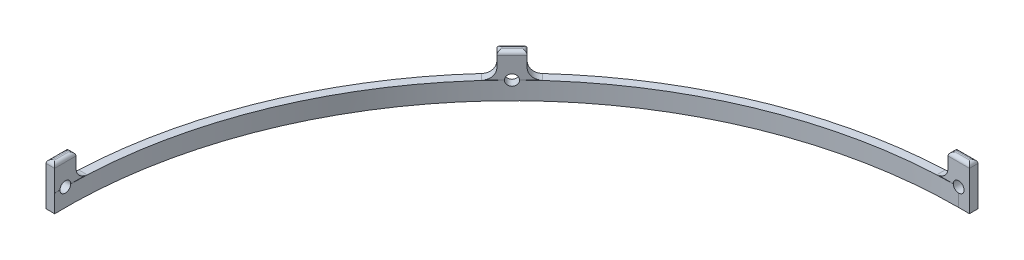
ISO-10303-21;
HEADER;
FILE_DESCRIPTION(('STEP AP214'),'2;1');
FILE_NAME('part.step','',(''),(''),'','','');
FILE_SCHEMA(('AUTOMOTIVE_DESIGN { 1 0 10303 214 1 1 1 1 }'));
ENDSEC;
DATA;
#1=APPLICATION_CONTEXT('core data for automotive mechanical design processes');
#2=APPLICATION_PROTOCOL_DEFINITION('international standard','automotive_design',2000,#1);
#3=PRODUCT_CONTEXT('',#1,'mechanical');
#4=PRODUCT('Part','Part','',(#3));
#5=PRODUCT_RELATED_PRODUCT_CATEGORY('part','',(#4));
#6=PRODUCT_DEFINITION_FORMATION('','',#4);
#7=PRODUCT_DEFINITION_CONTEXT('part definition',#1,'design');
#8=PRODUCT_DEFINITION('design','',#6,#7);
#9=PRODUCT_DEFINITION_SHAPE('','',#8);
#10=(LENGTH_UNIT() NAMED_UNIT(*) SI_UNIT(.MILLI.,.METRE.));
#11=(NAMED_UNIT(*) PLANE_ANGLE_UNIT() SI_UNIT($,.RADIAN.));
#12=(NAMED_UNIT(*) SI_UNIT($,.STERADIAN.) SOLID_ANGLE_UNIT());
#13=UNCERTAINTY_MEASURE_WITH_UNIT(LENGTH_MEASURE(1.E-05),#10,'distance_accuracy_value','');
#14=(GEOMETRIC_REPRESENTATION_CONTEXT(3) GLOBAL_UNCERTAINTY_ASSIGNED_CONTEXT((#13)) GLOBAL_UNIT_ASSIGNED_CONTEXT((#10,
#11,#12)) REPRESENTATION_CONTEXT('',''));
#15=CARTESIAN_POINT('',(0.,0.,0.));
#16=DIRECTION('',(0.,0.,1.));
#17=DIRECTION('',(1.,0.,0.));
#18=AXIS2_PLACEMENT_3D('',#15,#16,#17);
#19=CARTESIAN_POINT('',(0.,5.,0.));
#20=DIRECTION('',(0.,1.,0.));
#21=DIRECTION('',(0.,0.,1.));
#22=AXIS2_PLACEMENT_3D('',#19,#20,#21);
#23=PLANE('',#22);
#24=DIRECTION('',(0.,0.,1.));
#25=VECTOR('',#24,1.);
#26=CARTESIAN_POINT('',(-125.,5.,0.));
#27=LINE('',#26,#25);
#28=CARTESIAN_POINT('',(-125.,5.,1.49999999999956));
#29=VERTEX_POINT('',#28);
#30=CARTESIAN_POINT('',(-125.,5.,2.99999999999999));
#31=VERTEX_POINT('',#30);
#32=EDGE_CURVE('E653',#29,#31,#27,.T.);
#33=ORIENTED_EDGE('',*,*,#32,.T.);
#34=DIRECTION('',(1.,0.,0.));
#35=VECTOR('',#34,1.);
#36=CARTESIAN_POINT('',(0.,5.,2.99999999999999));
#37=LINE('',#36,#35);
#38=CARTESIAN_POINT('',(-124.963994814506,5.,2.99999999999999));
#39=VERTEX_POINT('',#38);
#40=EDGE_CURVE('E284',#31,#39,#37,.T.);
#41=ORIENTED_EDGE('',*,*,#40,.T.);
#42=CARTESIAN_POINT('',(0.,5.,0.));
#43=DIRECTION('',(0.,-1.,0.));
#44=DIRECTION('',(0.,0.,1.));
#45=AXIS2_PLACEMENT_3D('',#42,#43,#44);
#46=CIRCLE('',#45,125.);
#47=CARTESIAN_POINT('',(-124.990999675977,5.,1.49999999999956));
#48=VERTEX_POINT('',#47);
#49=EDGE_CURVE('E281',#39,#48,#46,.T.);
#50=ORIENTED_EDGE('',*,*,#49,.T.);
#51=DIRECTION('',(-1.,0.,0.));
#52=VECTOR('',#51,1.);
#53=CARTESIAN_POINT('',(-124.4,5.,1.49999999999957));
#54=LINE('',#53,#52);
#55=EDGE_CURVE('E610',#29,#48,#54,.F.);
#56=ORIENTED_EDGE('',*,*,#55,.F.);
#57=EDGE_LOOP('',(#33,#41,#50,#56));
#58=FACE_BOUND('',#57,.T.);
#59=ADVANCED_FACE('F42',(#58),#23,.T.);
#60=CARTESIAN_POINT('',(0.,5.,0.));
#61=DIRECTION('',(0.,-1.,0.));
#62=DIRECTION('',(0.,0.,-1.));
#63=AXIS2_PLACEMENT_3D('',#60,#61,#62);
#64=CYLINDRICAL_SURFACE('',#63,125.);
#65=DIRECTION('',(0.,-1.,0.));
#66=VECTOR('',#65,1.);
#67=CARTESIAN_POINT('',(-124.963994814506,5.,2.99999999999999));
#68=LINE('',#67,#66);
#69=CARTESIAN_POINT('',(-124.963994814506,0.,2.99999999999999));
#70=VERTEX_POINT('',#69);
#71=EDGE_CURVE('E262',#70,#39,#68,.F.);
#72=ORIENTED_EDGE('',*,*,#71,.F.);
#73=CARTESIAN_POINT('',(0.,0.,0.));
#74=DIRECTION('',(0.,-1.,0.));
#75=DIRECTION('',(0.,0.,1.));
#76=AXIS2_PLACEMENT_3D('',#73,#74,#75);
#77=CIRCLE('',#76,125.);
#78=CARTESIAN_POINT('',(0.,0.,-125.));
#79=VERTEX_POINT('',#78);
#80=EDGE_CURVE('E278',#70,#79,#77,.T.);
#81=ORIENTED_EDGE('',*,*,#80,.T.);
#82=DIRECTION('',(0.,-1.,0.));
#83=VECTOR('',#82,1.);
#84=CARTESIAN_POINT('',(0.,5.,-125.));
#85=LINE('',#84,#83);
#86=CARTESIAN_POINT('',(0.,3.49999999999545,-125.));
#87=VERTEX_POINT('',#86);
#88=EDGE_CURVE('E322',#87,#79,#85,.T.);
#89=ORIENTED_EDGE('',*,*,#88,.F.);
#90=CARTESIAN_POINT('',(0.,6.49999999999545,-125.));
#91=CARTESIAN_POINT('',(0.0842524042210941,6.4999962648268,-124.999999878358));
#92=CARTESIAN_POINT('',(0.168565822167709,6.49287771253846,-124.999913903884));
#93=CARTESIAN_POINT('',(0.334870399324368,6.46457930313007,-124.999579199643));
#94=CARTESIAN_POINT('',(0.41685864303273,6.44338254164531,-124.99933027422));
#95=CARTESIAN_POINT('',(0.576079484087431,6.38753142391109,-124.998697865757));
#96=CARTESIAN_POINT('',(0.653314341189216,6.35288352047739,-124.998314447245));
#97=CARTESIAN_POINT('',(0.800849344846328,6.2711225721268,-124.997456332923));
#98=CARTESIAN_POINT('',(0.871151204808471,6.22401261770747,-124.99698165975));
#99=CARTESIAN_POINT('',(1.00286016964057,6.11865282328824,-124.99599440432));
#100=CARTESIAN_POINT('',(1.06426594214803,6.06040131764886,-124.995481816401));
#101=CARTESIAN_POINT('',(1.17642884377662,5.93441368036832,-124.994476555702));
#102=CARTESIAN_POINT('',(1.22718555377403,5.86667717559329,-124.993983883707));
#103=CARTESIAN_POINT('',(1.3166072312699,5.7236430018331,-124.993074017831));
#104=CARTESIAN_POINT('',(1.35527205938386,5.64834524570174,-124.99265682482));
#105=CARTESIAN_POINT('',(1.41941123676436,5.49232675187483,-124.991944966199));
#106=CARTESIAN_POINT('',(1.44488561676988,5.41160602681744,-124.991650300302));
#107=CARTESIAN_POINT('',(1.48191972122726,5.24703690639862,-124.991216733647));
#108=CARTESIAN_POINT('',(1.49348009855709,5.16318865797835,-124.991077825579));
#109=CARTESIAN_POINT('',(1.50236002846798,4.99474149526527,-124.99097141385));
#110=CARTESIAN_POINT('',(1.49967961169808,4.91014258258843,-124.99100390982));
#111=CARTESIAN_POINT('',(1.48015466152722,4.74260001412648,-124.991236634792));
#112=CARTESIAN_POINT('',(1.46331085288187,4.65965627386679,-124.991436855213));
#113=CARTESIAN_POINT('',(1.41593836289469,4.49777387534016,-124.991982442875));
#114=CARTESIAN_POINT('',(1.3854096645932,4.41883522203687,-124.992327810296));
#115=CARTESIAN_POINT('',(1.31153318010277,4.26720157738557,-124.993124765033));
#116=CARTESIAN_POINT('',(1.26818506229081,4.19450674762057,-124.993576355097));
#117=CARTESIAN_POINT('',(1.16990052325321,4.05742612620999,-124.994534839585));
#118=CARTESIAN_POINT('',(1.11496410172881,3.9930403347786,-124.995041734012));
#119=CARTESIAN_POINT('',(0.995058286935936,3.87440122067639,-124.996053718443));
#120=CARTESIAN_POINT('',(0.93008826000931,3.82014853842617,-124.996558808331));
#121=CARTESIAN_POINT('',(0.791961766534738,3.72332063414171,-124.997510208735));
#122=CARTESIAN_POINT('',(0.718805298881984,3.68074541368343,-124.997956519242));
#123=CARTESIAN_POINT('',(0.566382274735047,3.60848109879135,-124.998740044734));
#124=CARTESIAN_POINT('',(0.487115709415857,3.57879202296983,-124.999077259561));
#125=CARTESIAN_POINT('',(0.32472278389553,3.5331431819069,-124.999604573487));
#126=CARTESIAN_POINT('',(0.241596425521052,3.51718341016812,-124.999794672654));
#127=CARTESIAN_POINT('',(0.0738491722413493,3.49944700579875,-125.000006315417));
#128=CARTESIAN_POINT('',(-0.0107716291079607,3.49766948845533,-125.000027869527));
#129=CARTESIAN_POINT('',(-0.179110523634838,3.50834574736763,-124.999900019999));
#130=CARTESIAN_POINT('',(-0.262828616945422,3.5207995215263,-124.999750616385));
#131=CARTESIAN_POINT('',(-0.426983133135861,3.55958410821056,-124.999297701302));
#132=CARTESIAN_POINT('',(-0.507419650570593,3.58591452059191,-124.998994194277));
#133=CARTESIAN_POINT('',(-0.662730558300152,3.65170453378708,-124.998267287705));
#134=CARTESIAN_POINT('',(-0.737604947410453,3.69116413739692,-124.997843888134));
#135=CARTESIAN_POINT('',(-0.87967022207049,3.78209467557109,-124.996924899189));
#136=CARTESIAN_POINT('',(-0.946860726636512,3.83356620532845,-124.996429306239));
#137=CARTESIAN_POINT('',(-1.07164709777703,3.94705862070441,-124.995421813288));
#138=CARTESIAN_POINT('',(-1.12924295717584,4.00907951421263,-124.994909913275));
#139=CARTESIAN_POINT('',(-1.23320799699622,4.14191386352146,-124.993927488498));
#140=CARTESIAN_POINT('',(-1.27957660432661,4.21272776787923,-124.993456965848));
#141=CARTESIAN_POINT('',(-1.35976692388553,4.36113558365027,-124.992610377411));
#142=CARTESIAN_POINT('',(-1.39358865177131,4.43872948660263,-124.992234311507));
#143=CARTESIAN_POINT('',(-1.44772416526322,4.59849251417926,-124.991619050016));
#144=CARTESIAN_POINT('',(-1.46803832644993,4.68066151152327,-124.991379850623));
#145=CARTESIAN_POINT('',(-1.49458330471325,4.84724414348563,-124.991065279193));
#146=CARTESIAN_POINT('',(-1.50081410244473,4.93165778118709,-124.99098990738));
#147=CARTESIAN_POINT('',(-1.49901538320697,5.10032748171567,-124.991011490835));
#148=CARTESIAN_POINT('',(-1.49098678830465,5.18458355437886,-124.99110843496));
#149=CARTESIAN_POINT('',(-1.46089904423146,5.35055197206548,-124.991463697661));
#150=CARTESIAN_POINT('',(-1.43883986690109,5.43226431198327,-124.991722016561));
#151=CARTESIAN_POINT('',(-1.38131684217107,5.59082714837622,-124.992370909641));
#152=CARTESIAN_POINT('',(-1.34585274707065,5.66767755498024,-124.992761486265));
#153=CARTESIAN_POINT('',(-1.26252817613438,5.81433086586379,-124.993630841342));
#154=CARTESIAN_POINT('',(-1.21466818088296,5.88413404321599,-124.994109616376));
#155=CARTESIAN_POINT('',(-1.10791254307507,6.01471265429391,-124.995101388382));
#156=CARTESIAN_POINT('',(-1.0490173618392,6.07548846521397,-124.995614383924));
#157=CARTESIAN_POINT('',(-0.921842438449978,6.18630543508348,-124.996616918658));
#158=CARTESIAN_POINT('',(-0.853560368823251,6.2363439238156,-124.997106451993));
#159=CARTESIAN_POINT('',(-0.709535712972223,6.32426745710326,-124.998006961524));
#160=CARTESIAN_POINT('',(-0.633789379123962,6.36214635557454,-124.998417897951));
#161=CARTESIAN_POINT('',(-0.477071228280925,6.42460600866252,-124.999114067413));
#162=CARTESIAN_POINT('',(-0.396105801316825,6.44920269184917,-124.99939945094));
#163=CARTESIAN_POINT('',(-0.262187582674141,6.47785009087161,-124.99973571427));
#164=CARTESIAN_POINT('',(-0.210104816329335,6.48614592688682,-124.999834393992));
#165=CARTESIAN_POINT('',(-0.105355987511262,6.49722204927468,-124.999966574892));
#166=CARTESIAN_POINT('',(-0.0526899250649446,6.50000233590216,-125.000000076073));
#167=CARTESIAN_POINT('',(0.,6.49999999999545,-125.));
#168=B_SPLINE_CURVE_WITH_KNOTS('',3,(#90,#91,#92,#93,#94,#95,#96,#97,#98,#99,#100,#101,#102,
#103,#104,#105,#106,#107,#108,#109,#110,#111,#112,#113,#114,#115,#116,#117,#118,#119,#120,#121,
#122,#123,#124,#125,#126,#127,#128,#129,#130,#131,#132,#133,#134,#135,#136,#137,#138,#139,#140,
#141,#142,#143,#144,#145,#146,#147,#148,#149,#150,#151,#152,#153,#154,#155,#156,#157,#158,#159,
#160,#161,#162,#163,#164,#165,#166,#167),.UNSPECIFIED.,.T.,.F.,(4,2,2,2,2,2,2,2,2,2,2,2,2,2,2,2,
2,2,2,2,2,2,2,2,2,2,2,2,2,2,2,2,2,2,2,2,2,2,4),(0.,0.252564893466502,0.505433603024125,
0.75818115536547,1.01086608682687,1.26358882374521,1.51632150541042,1.76905710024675,
2.02179210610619,2.2745152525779,2.52723785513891,2.77994752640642,3.03265751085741,
3.28537403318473,3.53809056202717,3.79082305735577,4.04355558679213,4.29628848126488,
4.54902125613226,4.80173826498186,5.05445523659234,5.30716492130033,5.55987465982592,
5.81259692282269,6.06531937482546,6.31805472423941,6.5707897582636,6.82351776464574,
7.07624611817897,7.32895812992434,7.58167064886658,7.83438783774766,8.08709523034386,
8.33979206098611,8.59255166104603,8.84543881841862,9.09802202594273,9.25597153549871,
9.413921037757),.UNSPECIFIED.);
#169=CARTESIAN_POINT('',(-1.5,5.,-124.990999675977));
#170=VERTEX_POINT('',#169);
#171=EDGE_CURVE('E691',#87,#170,#168,.T.);
#172=ORIENTED_EDGE('',*,*,#171,.T.);
#173=CARTESIAN_POINT('',(-87.3213232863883,5.,-89.4426436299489));
#174=VERTEX_POINT('',#173);
#175=EDGE_CURVE('E315',#174,#170,#46,.T.);
#176=ORIENTED_EDGE('',*,*,#175,.F.);
#177=CARTESIAN_POINT('',(-89.442643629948,4.99999999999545,-87.3213232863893));
#178=CARTESIAN_POINT('',(-89.4426410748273,5.08425240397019,-87.3213260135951));
#179=CARTESIAN_POINT('',(-89.4376682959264,5.16856582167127,-87.3264203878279));
#180=CARTESIAN_POINT('',(-89.4178949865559,5.33487039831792,-87.3466670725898));
#181=CARTESIAN_POINT('',(-89.403082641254,5.41685864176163,-87.3618314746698));
#182=CARTESIAN_POINT('',(-89.3640371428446,5.5760794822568,-87.4017713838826));
#183=CARTESIAN_POINT('',(-89.3398085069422,5.65331433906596,-87.426542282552));
#184=CARTESIAN_POINT('',(-89.2826015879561,5.80084934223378,-87.4849628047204));
#185=CARTESIAN_POINT('',(-89.2496254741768,5.87115120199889,-87.5186102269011));
#186=CARTESIAN_POINT('',(-89.1758229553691,6.00286016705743,-87.5938089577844));
#187=CARTESIAN_POINT('',(-89.1349953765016,6.064265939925,-87.63536144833));
#188=CARTESIAN_POINT('',(-89.0466194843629,6.17642884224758,-87.7251589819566));
#189=CARTESIAN_POINT('',(-88.999070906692,6.22718555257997,-87.7734042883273));
#190=CARTESIAN_POINT('',(-88.8985738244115,6.31660723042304,-87.875188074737));
#191=CARTESIAN_POINT('',(-88.8456252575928,6.35527205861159,-87.9287266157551));
#192=CARTESIAN_POINT('',(-88.7358068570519,6.41941123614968,-88.0395516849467));
#193=CARTESIAN_POINT('',(-88.6789370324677,6.44488561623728,-88.0968382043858));
#194=CARTESIAN_POINT('',(-88.5628756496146,6.48191972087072,-88.2135127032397));
#195=CARTESIAN_POINT('',(-88.5036842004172,6.49348009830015,-88.272900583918));
#196=CARTESIAN_POINT('',(-88.3846493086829,6.50236002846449,-88.3920859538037));
#197=CARTESIAN_POINT('',(-88.3248058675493,6.49967961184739,-88.4518834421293));
#198=CARTESIAN_POINT('',(-88.2061708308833,6.48015466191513,-88.5701893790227));
#199=CARTESIAN_POINT('',(-88.1473791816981,6.46331085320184,-88.6286978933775));
#200=CARTESIAN_POINT('',(-88.0325252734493,6.41593836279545,-88.7427802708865));
#201=CARTESIAN_POINT('',(-87.9764630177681,6.3854096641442,-88.7983541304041));
#202=CARTESIAN_POINT('',(-87.8686783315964,6.31153317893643,-88.9050118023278));
#203=CARTESIAN_POINT('',(-87.8169560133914,6.26818506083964,-88.9560954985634));
#204=CARTESIAN_POINT('',(-87.7193476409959,6.16990052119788,-89.0523484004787));
#205=CARTESIAN_POINT('',(-87.673461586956,6.11496409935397,-89.0975176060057));
#206=CARTESIAN_POINT('',(-87.5888554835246,5.99505828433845,-89.1806925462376));
#207=CARTESIAN_POINT('',(-87.5501358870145,5.9300882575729,-89.2186978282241));
#208=CARTESIAN_POINT('',(-87.4809954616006,5.79196176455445,-89.2864927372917));
#209=CARTESIAN_POINT('',(-87.4505746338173,5.71880529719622,-89.3162823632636));
#210=CARTESIAN_POINT('',(-87.3989219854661,5.56638227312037,-89.3668268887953));
#211=CARTESIAN_POINT('',(-87.3776901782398,5.48711570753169,-89.3875817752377));
#212=CARTESIAN_POINT('',(-87.3450386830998,5.32472278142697,-89.4194874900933));
#213=CARTESIAN_POINT('',(-87.3336189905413,5.24159642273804,-89.4306383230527));
#214=CARTESIAN_POINT('',(-87.3209277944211,5.07384916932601,-89.4430301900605));
#215=CARTESIAN_POINT('',(-87.3196556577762,4.98922836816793,-89.4442718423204));
#216=CARTESIAN_POINT('',(-87.3272953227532,4.82088947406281,-89.4368129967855));
#217=CARTESIAN_POINT('',(-87.3362071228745,4.73717138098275,-89.4281125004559));
#218=CARTESIAN_POINT('',(-87.3639522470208,4.57301686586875,-89.4010079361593));
#219=CARTESIAN_POINT('',(-87.3827852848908,4.49258034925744,-89.3826041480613));
#220=CARTESIAN_POINT('',(-87.429819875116,4.33726944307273,-89.3365976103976));
#221=CARTESIAN_POINT('',(-87.4580214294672,4.26239505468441,-89.3089948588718));
#222=CARTESIAN_POINT('',(-87.5229688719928,4.12032978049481,-89.2453471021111));
#223=CARTESIAN_POINT('',(-87.5597151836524,4.05313927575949,-89.2093016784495));
#224=CARTESIAN_POINT('',(-87.6406788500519,3.92835290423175,-89.1297628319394));
#225=CARTESIAN_POINT('',(-87.6848962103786,3.87075704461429,-89.0862694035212));
#226=CARTESIAN_POINT('',(-87.7795189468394,3.76679200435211,-88.9930360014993));
#227=CARTESIAN_POINT('',(-87.8299246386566,3.72042339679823,-88.9432957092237));
#228=CARTESIAN_POINT('',(-87.935463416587,3.6402330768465,-88.838954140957));
#229=CARTESIAN_POINT('',(-87.9905964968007,3.60641134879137,-88.7843528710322));
#230=CARTESIAN_POINT('',(-88.1040010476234,3.55227583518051,-88.6718183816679));
#231=CARTESIAN_POINT('',(-88.1622724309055,3.53196167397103,-88.6138852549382));
#232=CARTESIAN_POINT('',(-88.2802865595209,3.50541669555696,-88.4963159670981));
#233=CARTESIAN_POINT('',(-88.3400293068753,3.49918589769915,-88.4366798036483));
#234=CARTESIAN_POINT('',(-88.4592815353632,3.50098461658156,-88.3173970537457));
#235=CARTESIAN_POINT('',(-88.518791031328,3.50901321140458,-88.2577504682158));
#236=CARTESIAN_POINT('',(-88.6358972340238,3.53910095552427,-88.1401418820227));
#237=CARTESIAN_POINT('',(-88.6934939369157,3.5611601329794,-88.0821798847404));
#238=CARTESIAN_POINT('',(-88.8051559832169,3.61868315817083,-87.9696002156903));
#239=CARTESIAN_POINT('',(-88.8592212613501,3.65414725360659,-87.9149826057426));
#240=CARTESIAN_POINT('',(-88.9623061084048,3.73747182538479,-87.810668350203));
#241=CARTESIAN_POINT('',(-89.0113258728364,3.7853318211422,-87.7609715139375));
#242=CARTESIAN_POINT('',(-89.1029576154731,3.89208745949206,-87.6679372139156));
#243=CARTESIAN_POINT('',(-89.1455698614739,3.95098264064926,-87.6245994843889));
#244=CARTESIAN_POINT('',(-89.2232203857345,4.0781575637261,-87.5455311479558));
#245=CARTESIAN_POINT('',(-89.258256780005,4.14643963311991,-87.5098024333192));
#246=CARTESIAN_POINT('',(-89.3197913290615,4.29046428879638,-87.4469943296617));
#247=CARTESIAN_POINT('',(-89.3462851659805,4.36621062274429,-87.4199193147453));
#248=CARTESIAN_POINT('',(-89.3899585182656,4.52292877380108,-87.3752613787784));
#249=CARTESIAN_POINT('',(-89.4071491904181,4.60389420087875,-87.3576670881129));
#250=CARTESIAN_POINT('',(-89.427168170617,4.73781241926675,-87.3371725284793));
#251=CARTESIAN_POINT('',(-89.4329644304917,4.78989518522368,-87.3312367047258));
#252=CARTESIAN_POINT('',(-89.4407029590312,4.89464401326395,-87.3233112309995));
#253=CARTESIAN_POINT('',(-89.4426452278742,4.94731007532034,-87.3213215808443));
#254=CARTESIAN_POINT('',(-89.442643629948,4.99999999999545,-87.3213232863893));
#255=B_SPLINE_CURVE_WITH_KNOTS('',3,(#177,#178,#179,#180,#181,#182,#183,#184,#185,#186,#187,
#188,#189,#190,#191,#192,#193,#194,#195,#196,#197,#198,#199,#200,#201,#202,#203,#204,#205,#206,
#207,#208,#209,#210,#211,#212,#213,#214,#215,#216,#217,#218,#219,#220,#221,#222,#223,#224,#225,
#226,#227,#228,#229,#230,#231,#232,#233,#234,#235,#236,#237,#238,#239,#240,#241,#242,#243,#244,
#245,#246,#247,#248,#249,#250,#251,#252,#253,#254),.UNSPECIFIED.,.T.,.F.,(4,2,2,2,2,2,2,2,2,2,2,
2,2,2,2,2,2,2,2,2,2,2,2,2,2,2,2,2,2,2,2,2,2,2,2,2,2,2,4),(0.,0.252564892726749,
0.505433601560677,0.758181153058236,1.01086608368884,1.26358882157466,1.51632150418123,
1.76905709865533,2.02179210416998,2.27451525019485,2.52723785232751,2.77994752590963,
3.03265751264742,3.28537403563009,3.53809056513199,3.79082305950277,4.04355558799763,
4.29628848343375,4.54902125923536,4.80173826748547,5.05445523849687,5.30716492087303,
5.55987465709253,5.81259692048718,6.06531937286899,6.31805472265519,6.57078975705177,
6.82351776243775,7.07624611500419,7.32895812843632,7.5816706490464,7.8343878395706,
8.08709523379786,8.33979206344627,8.5925516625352,8.8454388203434,9.09802202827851,
9.25597153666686,9.41392103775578),.UNSPECIFIED.);
#256=CARTESIAN_POINT('',(-89.442643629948,5.,-87.3213232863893));
#257=VERTEX_POINT('',#256);
#258=EDGE_CURVE('E616',#174,#257,#255,.T.);
#259=ORIENTED_EDGE('',*,*,#258,.T.);
#260=CARTESIAN_POINT('',(-124.990999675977,5.,-1.50000000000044));
#261=VERTEX_POINT('',#260);
#262=EDGE_CURVE('E605',#261,#257,#46,.T.);
#263=ORIENTED_EDGE('',*,*,#262,.F.);
#264=CARTESIAN_POINT('',(-124.990999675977,4.99999999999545,1.49999999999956));
#265=CARTESIAN_POINT('',(-124.990999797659,5.08425240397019,1.49999626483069));
#266=CARTESIAN_POINT('',(-124.991085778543,5.16856582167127,1.49287771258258));
#267=CARTESIAN_POINT('',(-124.991420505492,5.33487039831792,1.46457930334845));
#268=CARTESIAN_POINT('',(-124.991669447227,5.41685864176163,1.4433825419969));
#269=CARTESIAN_POINT('',(-124.992301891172,5.5760794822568,1.38753142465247));
#270=CARTESIAN_POINT('',(-124.992685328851,5.65331433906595,1.35288352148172));
#271=CARTESIAN_POINT('',(-124.993543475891,5.80084934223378,1.27112257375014));
#272=CARTESIAN_POINT('',(-124.994018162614,5.87115120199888,1.2240126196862));
#273=CARTESIAN_POINT('',(-124.995005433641,6.00286016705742,1.11865282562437));
#274=CARTESIAN_POINT('',(-124.995518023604,6.064265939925,1.06040131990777));
#275=CARTESIAN_POINT('',(-124.996523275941,6.17642884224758,0.934413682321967));
#276=CARTESIAN_POINT('',(-124.997015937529,6.22718555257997,0.866677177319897));
#277=CARTESIAN_POINT('',(-124.997925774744,6.31660723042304,0.723643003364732));
#278=CARTESIAN_POINT('',(-124.998342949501,6.35527205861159,0.648345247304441));
#279=CARTESIAN_POINT('',(-124.99905477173,6.41941123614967,0.49232675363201));
#280=CARTESIAN_POINT('',(-124.999349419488,6.44488561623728,0.411606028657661));
#281=CARTESIAN_POINT('',(-124.99978295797,6.48191972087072,0.247036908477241));
#282=CARTESIAN_POINT('',(-124.999921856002,6.49348009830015,0.163188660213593));
#283=CARTESIAN_POINT('',(-125.000028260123,6.50236002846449,-0.00525850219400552));
#284=CARTESIAN_POINT('',(-124.999995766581,6.49967961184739,-0.0898574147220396));
#285=CARTESIAN_POINT('',(-124.9997630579,6.48015466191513,-0.257399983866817));
#286=CARTESIAN_POINT('',(-124.999562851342,6.46331085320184,-0.340343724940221));
#287=CARTESIAN_POINT('',(-124.999017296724,6.41593836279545,-0.502226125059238));
#288=CARTESIAN_POINT('',(-124.998671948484,6.3854096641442,-0.581164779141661));
#289=CARTESIAN_POINT('',(-124.997875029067,6.31153317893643,-0.73279842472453));
#290=CARTESIAN_POINT('',(-124.997423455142,6.26818506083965,-0.805493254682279));
#291=CARTESIAN_POINT('',(-124.996464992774,6.16990052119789,-0.94257387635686));
#292=CARTESIAN_POINT('',(-124.995958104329,6.11496409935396,-1.00695966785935));
#293=CARTESIAN_POINT('',(-124.994946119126,5.99505828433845,-1.12559878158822));
#294=CARTESIAN_POINT('',(-124.994441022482,5.9300882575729,-1.17985146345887));
#295=CARTESIAN_POINT('',(-124.99348959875,5.79196176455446,-1.27667936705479));
#296=CARTESIAN_POINT('',(-124.993043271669,5.71880529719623,-1.31925458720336));
#297=CARTESIAN_POINT('',(-124.992259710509,5.56638227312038,-1.39151890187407));
#298=CARTESIAN_POINT('',(-124.991922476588,5.4871157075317,-1.42120797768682));
#299=CARTESIAN_POINT('',(-124.991395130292,5.32472278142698,-1.46685681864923));
#300=CARTESIAN_POINT('',(-124.991205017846,5.24159642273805,-1.48281659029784));
#301=CARTESIAN_POINT('',(-124.990993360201,5.07384916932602,-1.50055299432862));
#302=CARTESIAN_POINT('',(-124.990971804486,4.98922836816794,-1.50233051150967));
#303=CARTESIAN_POINT('',(-124.991099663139,4.82088947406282,-1.49165425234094));
#304=CARTESIAN_POINT('',(-124.991249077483,4.73717138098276,-1.47920047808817));
#305=CARTESIAN_POINT('',(-124.991702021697,4.57301686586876,-1.44041589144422));
#306=CARTESIAN_POINT('',(-124.992005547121,4.49258034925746,-1.41408547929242));
#307=CARTESIAN_POINT('',(-124.992732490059,4.33726944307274,-1.34829546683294));
#308=CARTESIAN_POINT('',(-124.993155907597,4.26239505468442,-1.30883586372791));
#309=CARTESIAN_POINT('',(-124.994074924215,4.12032978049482,-1.2179053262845));
#310=CARTESIAN_POINT('',(-124.994570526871,4.05313927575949,-1.1664337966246));
#311=CARTESIAN_POINT('',(-124.995578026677,3.92835290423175,-1.05294138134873));
#312=CARTESIAN_POINT('',(-124.996089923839,3.8707570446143,-0.990920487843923));
#313=CARTESIAN_POINT('',(-124.997072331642,3.76679200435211,-0.858086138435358));
#314=CARTESIAN_POINT('',(-124.99754284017,3.72042339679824,-0.787272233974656));
#315=CARTESIAN_POINT('',(-124.998389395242,3.6402330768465,-0.638864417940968));
#316=CARTESIAN_POINT('',(-124.998765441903,3.60641134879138,-0.561270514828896));
#317=CARTESIAN_POINT('',(-124.999380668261,3.55227583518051,-0.401507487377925));
#318=CARTESIAN_POINT('',(-124.999619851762,3.53196167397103,-0.319338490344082));
#319=CARTESIAN_POINT('',(-124.999934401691,3.50541669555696,-0.152755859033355));
#320=CARTESIAN_POINT('',(-125.000009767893,3.49918589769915,-0.0683422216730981));
#321=CARTESIAN_POINT('',(-124.999988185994,3.50098461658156,0.100327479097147));
#322=CARTESIAN_POINT('',(-124.999891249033,3.50901321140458,0.184583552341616));
#323=CARTESIAN_POINT('',(-124.999536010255,3.53910095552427,0.350551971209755));
#324=CARTESIAN_POINT('',(-124.999277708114,3.5611601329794,0.432264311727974));
#325=CARTESIAN_POINT('',(-124.998628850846,3.61868315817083,0.590827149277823));
#326=CARTESIAN_POINT('',(-124.998238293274,3.65414725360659,0.667677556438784));
#327=CARTESIAN_POINT('',(-124.997368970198,3.73747182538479,0.814330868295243));
#328=CARTESIAN_POINT('',(-124.996890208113,3.7853318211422,0.88413404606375));
#329=CARTESIAN_POINT('',(-124.995898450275,3.89208745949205,1.01471265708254));
#330=CARTESIAN_POINT('',(-124.995385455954,3.95098264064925,1.07548846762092));
#331=CARTESIAN_POINT('',(-124.994382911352,4.07815756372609,1.18630543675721));
#332=CARTESIAN_POINT('',(-124.993893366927,4.1464396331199,1.23634392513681));
#333=CARTESIAN_POINT('',(-124.992992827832,4.29046428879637,1.32426745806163));
#334=CARTESIAN_POINT('',(-124.992581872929,4.36621062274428,1.36214635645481));
#335=CARTESIAN_POINT('',(-124.991885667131,4.52292877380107,1.42460600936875));
#336=CARTESIAN_POINT('',(-124.991600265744,4.60389420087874,1.44920269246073));
#337=CARTESIAN_POINT('',(-124.9912639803,4.73781241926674,1.47785009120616));
#338=CARTESIAN_POINT('',(-124.991165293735,4.78989518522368,1.4861459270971));
#339=CARTESIAN_POINT('',(-124.991033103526,4.89464401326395,1.49722204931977));
#340=CARTESIAN_POINT('',(-124.990999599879,4.94731007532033,1.5000023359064));
#341=CARTESIAN_POINT('',(-124.990999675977,4.99999999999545,1.49999999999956));
#342=B_SPLINE_CURVE_WITH_KNOTS('',3,(#264,#265,#266,#267,#268,#269,#270,#271,#272,#273,#274,
#275,#276,#277,#278,#279,#280,#281,#282,#283,#284,#285,#286,#287,#288,#289,#290,#291,#292,#293,
#294,#295,#296,#297,#298,#299,#300,#301,#302,#303,#304,#305,#306,#307,#308,#309,#310,#311,#312,
#313,#314,#315,#316,#317,#318,#319,#320,#321,#322,#323,#324,#325,#326,#327,#328,#329,#330,#331,
#332,#333,#334,#335,#336,#337,#338,#339,#340,#341),.UNSPECIFIED.,.T.,.F.,(4,2,2,2,2,2,2,2,2,2,2,
2,2,2,2,2,2,2,2,2,2,2,2,2,2,2,2,2,2,2,2,2,2,2,2,2,2,2,4),(0.,0.252564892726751,
0.505433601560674,0.758181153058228,1.01086608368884,1.26358882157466,1.51632150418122,
1.76905709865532,2.02179210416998,2.27451525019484,2.52723785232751,2.77994752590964,
3.03265751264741,3.28537403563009,3.53809056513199,3.79082305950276,4.04355558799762,
4.29628848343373,4.54902125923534,4.80173826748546,5.05445523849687,5.30716492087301,
5.55987465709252,5.81259692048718,6.06531937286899,6.31805472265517,6.57078975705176,
6.82351776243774,7.07624611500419,7.32895812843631,7.5816706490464,7.8343878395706,
8.08709523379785,8.33979206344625,8.5925516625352,8.84543882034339,9.0980220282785,
9.25597153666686,9.41392103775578),.UNSPECIFIED.);
#343=EDGE_CURVE('E614',#261,#48,#342,.T.);
#344=ORIENTED_EDGE('',*,*,#343,.T.);
#345=ORIENTED_EDGE('',*,*,#49,.F.);
#346=EDGE_LOOP('',(#72,#81,#89,#172,#176,#259,#263,#344,#345));
#347=FACE_BOUND('',#346,.T.);
#348=ADVANCED_FACE('F276',(#347),#64,.F.);
#349=CARTESIAN_POINT('',(0.,0.,0.));
#350=DIRECTION('',(0.,1.,0.));
#351=DIRECTION('',(0.,0.,1.));
#352=AXIS2_PLACEMENT_3D('',#349,#350,#351);
#353=PLANE('',#352);
#354=ORIENTED_EDGE('',*,*,#80,.F.);
#355=DIRECTION('',(1.,0.,0.));
#356=VECTOR('',#355,1.);
#357=CARTESIAN_POINT('',(-127.4,0.,2.99999999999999));
#358=LINE('',#357,#356);
#359=CARTESIAN_POINT('',(-127.4,0.,2.99999999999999));
#360=VERTEX_POINT('',#359);
#361=EDGE_CURVE('E259',#360,#70,#358,.T.);
#362=ORIENTED_EDGE('',*,*,#361,.F.);
#363=DIRECTION('',(0.,0.,1.));
#364=VECTOR('',#363,1.);
#365=CARTESIAN_POINT('',(-127.4,0.,-3.00000000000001));
#366=LINE('',#365,#364);
#367=CARTESIAN_POINT('',(-127.4,0.,-3.00000000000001));
#368=VERTEX_POINT('',#367);
#369=EDGE_CURVE('E272',#368,#360,#366,.T.);
#370=ORIENTED_EDGE('',*,*,#369,.F.);
#371=DIRECTION('',(-1.,0.,0.));
#372=VECTOR('',#371,1.);
#373=CARTESIAN_POINT('',(-127.4,0.,-3.00000000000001));
#374=LINE('',#373,#372);
#375=CARTESIAN_POINT('',(-127.364673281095,0.,-3.00000000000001));
#376=VERTEX_POINT('',#375);
#377=EDGE_CURVE('E659',#376,#368,#374,.T.);
#378=ORIENTED_EDGE('',*,*,#377,.F.);
#379=CARTESIAN_POINT('',(0.,0.,0.));
#380=DIRECTION('',(0.,1.,0.));
#381=DIRECTION('',(0.,0.,1.));
#382=AXIS2_PLACEMENT_3D('',#379,#380,#381);
#383=CIRCLE('',#382,127.4);
#384=CARTESIAN_POINT('',(-92.1817445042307,0.,-87.9391038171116));
#385=VERTEX_POINT('',#384);
#386=EDGE_CURVE('E311',#385,#376,#383,.T.);
#387=ORIENTED_EDGE('',*,*,#386,.F.);
#388=DIRECTION('',(0.707106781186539,0.,0.707106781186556));
#389=VECTOR('',#388,1.);
#390=CARTESIAN_POINT('',(-92.2067242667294,0.,-87.9640835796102));
#391=LINE('',#390,#389);
#392=CARTESIAN_POINT('',(-92.2067242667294,0.,-87.9640835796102));
#393=VERTEX_POINT('',#392);
#394=EDGE_CURVE('E650',#393,#385,#391,.T.);
#395=ORIENTED_EDGE('',*,*,#394,.F.);
#396=DIRECTION('',(-0.707106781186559,0.,0.707106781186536));
#397=VECTOR('',#396,1.);
#398=CARTESIAN_POINT('',(-87.96408357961,0.,-92.2067242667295));
#399=LINE('',#398,#397);
#400=CARTESIAN_POINT('',(-87.96408357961,0.,-92.2067242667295));
#401=VERTEX_POINT('',#400);
#402=EDGE_CURVE('E642',#401,#393,#399,.T.);
#403=ORIENTED_EDGE('',*,*,#402,.F.);
#404=DIRECTION('',(-0.707106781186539,0.,-0.707106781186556));
#405=VECTOR('',#404,1.);
#406=CARTESIAN_POINT('',(-87.96408357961,0.,-92.2067242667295));
#407=LINE('',#406,#405);
#408=CARTESIAN_POINT('',(-87.9391038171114,0.,-92.1817445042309));
#409=VERTEX_POINT('',#408);
#410=EDGE_CURVE('E646',#409,#401,#407,.T.);
#411=ORIENTED_EDGE('',*,*,#410,.F.);
#412=CARTESIAN_POINT('',(-3.00000000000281,0.,-127.364673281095));
#413=VERTEX_POINT('',#412);
#414=EDGE_CURVE('E312',#413,#409,#383,.T.);
#415=ORIENTED_EDGE('',*,*,#414,.F.);
#416=DIRECTION('',(0.,0.,1.));
#417=VECTOR('',#416,1.);
#418=CARTESIAN_POINT('',(-3.00000000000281,0.,-127.400000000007));
#419=LINE('',#418,#417);
#420=CARTESIAN_POINT('',(-3.00000000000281,0.,-127.400000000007));
#421=VERTEX_POINT('',#420);
#422=EDGE_CURVE('E678',#421,#413,#419,.T.);
#423=ORIENTED_EDGE('',*,*,#422,.F.);
#424=DIRECTION('',(-1.,0.,0.));
#425=VECTOR('',#424,1.);
#426=CARTESIAN_POINT('',(3.,0.,-127.4));
#427=LINE('',#426,#425);
#428=CARTESIAN_POINT('',(3.,0.,-127.4));
#429=VERTEX_POINT('',#428);
#430=EDGE_CURVE('E307',#429,#421,#427,.T.);
#431=ORIENTED_EDGE('',*,*,#430,.F.);
#432=DIRECTION('',(0.,0.,-1.));
#433=VECTOR('',#432,1.);
#434=CARTESIAN_POINT('',(3.,0.,-125.));
#435=LINE('',#434,#433);
#436=CARTESIAN_POINT('',(3.,0.,-125.));
#437=VERTEX_POINT('',#436);
#438=EDGE_CURVE('E296',#437,#429,#435,.T.);
#439=ORIENTED_EDGE('',*,*,#438,.F.);
#440=DIRECTION('',(1.,0.,0.));
#441=VECTOR('',#440,1.);
#442=CARTESIAN_POINT('',(0.,0.,-125.));
#443=LINE('',#442,#441);
#444=EDGE_CURVE('E290',#79,#437,#443,.T.);
#445=ORIENTED_EDGE('',*,*,#444,.F.);
#446=EDGE_LOOP('',(#354,#362,#370,#378,#387,#395,#403,#411,#415,#423,#431,#439,#445));
#447=FACE_BOUND('',#446,.T.);
#448=ADVANCED_FACE('F287',(#447),#353,.F.);
#449=CARTESIAN_POINT('',(-125.,12.,-3.00000000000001));
#450=DIRECTION('',(-1.,0.,0.));
#451=DIRECTION('',(0.,0.,1.));
#452=AXIS2_PLACEMENT_3D('',#449,#450,#451);
#453=PLANE('',#452);
#454=DIRECTION('',(0.,-1.,0.));
#455=VECTOR('',#454,1.);
#456=CARTESIAN_POINT('',(-125.,12.,2.99999999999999));
#457=LINE('',#456,#455);
#458=CARTESIAN_POINT('',(-125.,11.,2.99999999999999));
#459=VERTEX_POINT('',#458);
#460=EDGE_CURVE('E59',#459,#31,#457,.T.);
#461=ORIENTED_EDGE('',*,*,#460,.T.);
#462=ORIENTED_EDGE('',*,*,#32,.F.);
#463=CARTESIAN_POINT('',(-125.,4.99999999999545,-4.36435167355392E-13));
#464=DIRECTION('',(-1.,0.,0.));
#465=DIRECTION('',(0.,0.,1.));
#466=AXIS2_PLACEMENT_3D('',#463,#464,#465);
#467=CIRCLE('',#466,1.5);
#468=CARTESIAN_POINT('',(-125.,5.,-1.50000000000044));
#469=VERTEX_POINT('',#468);
#470=EDGE_CURVE('E611',#29,#469,#467,.T.);
#471=ORIENTED_EDGE('',*,*,#470,.T.);
#472=CARTESIAN_POINT('',(-125.,5.,-6.00000000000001));
#473=VERTEX_POINT('',#472);
#474=EDGE_CURVE('E606',#473,#469,#27,.T.);
#475=ORIENTED_EDGE('',*,*,#474,.F.);
#476=CARTESIAN_POINT('',(-125.,8.,-6.00000000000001));
#477=DIRECTION('',(-1.,0.,0.));
#478=DIRECTION('',(0.,0.,1.));
#479=AXIS2_PLACEMENT_3D('',#476,#477,#478);
#480=CIRCLE('',#479,3.);
#481=CARTESIAN_POINT('',(-125.,8.,-3.00000000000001));
#482=VERTEX_POINT('',#481);
#483=EDGE_CURVE('E333',#482,#473,#480,.F.);
#484=ORIENTED_EDGE('',*,*,#483,.F.);
#485=DIRECTION('',(0.,-1.,0.));
#486=VECTOR('',#485,1.);
#487=CARTESIAN_POINT('',(-125.,12.,-3.00000000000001));
#488=LINE('',#487,#486);
#489=CARTESIAN_POINT('',(-125.,11.,-3.00000000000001));
#490=VERTEX_POINT('',#489);
#491=EDGE_CURVE('E557',#490,#482,#488,.T.);
#492=ORIENTED_EDGE('',*,*,#491,.F.);
#493=DIRECTION('',(0.,0.,-1.));
#494=VECTOR('',#493,1.);
#495=CARTESIAN_POINT('',(-125.,11.,2.99999999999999));
#496=LINE('',#495,#494);
#497=EDGE_CURVE('E11',#490,#459,#496,.F.);
#498=ORIENTED_EDGE('',*,*,#497,.T.);
#499=EDGE_LOOP('',(#461,#462,#471,#475,#484,#492,#498));
#500=FACE_BOUND('',#499,.T.);
#501=ADVANCED_FACE('F555',(#500),#453,.F.);
#502=CARTESIAN_POINT('',(-6.00000000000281,8.,-127.400000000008));
#503=DIRECTION('',(0.,0.,1.));
#504=DIRECTION('',(1.,0.,0.));
#505=AXIS2_PLACEMENT_3D('',#502,#503,#504);
#506=CYLINDRICAL_SURFACE('',#505,3.);
#507=DIRECTION('',(0.,0.,1.));
#508=VECTOR('',#507,1.);
#509=CARTESIAN_POINT('',(-3.00000000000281,8.,-127.400000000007));
#510=LINE('',#509,#508);
#511=CARTESIAN_POINT('',(-3.00000000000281,8.,-127.364673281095));
#512=VERTEX_POINT('',#511);
#513=CARTESIAN_POINT('',(-3.00000000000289,8.,-125.000000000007));
#514=VERTEX_POINT('',#513);
#515=EDGE_CURVE('E410',#512,#514,#510,.T.);
#516=ORIENTED_EDGE('',*,*,#515,.F.);
#517=CARTESIAN_POINT('',(-6.00000000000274,5.,-127.258634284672));
#518=CARTESIAN_POINT('',(-5.91562311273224,4.99999194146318,-127.262613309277));
#519=CARTESIAN_POINT('',(-5.83124582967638,5.00355970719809,-127.266506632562));
#520=CARTESIAN_POINT('',(-5.66308593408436,5.01778662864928,-127.274099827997));
#521=CARTESIAN_POINT('',(-5.57930329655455,5.0284454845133,-127.27779970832));
#522=CARTESIAN_POINT('',(-5.41298468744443,5.05678347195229,-127.284981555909));
#523=CARTESIAN_POINT('',(-5.3304478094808,5.07445721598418,-127.288463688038));
#524=CARTESIAN_POINT('',(-5.16716830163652,5.116683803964,-127.295196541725));
#525=CARTESIAN_POINT('',(-5.08642564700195,5.1412365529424,-127.298447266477));
#526=CARTESIAN_POINT('',(-4.84766596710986,5.22501945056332,-127.307837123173));
#527=CARTESIAN_POINT('',(-4.69305326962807,5.29438520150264,-127.313616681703));
#528=CARTESIAN_POINT('',(-4.3977580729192,5.45808001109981,-127.324159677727));
#529=CARTESIAN_POINT('',(-4.25707374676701,5.55240578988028,-127.328923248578));
#530=CARTESIAN_POINT('',(-3.99359736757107,5.76330846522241,-127.337459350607));
#531=CARTESIAN_POINT('',(-3.87079371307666,5.87987081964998,-127.341232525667));
#532=CARTESIAN_POINT('',(-3.64649798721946,6.13198095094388,-127.347853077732));
#533=CARTESIAN_POINT('',(-3.54500593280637,6.26752874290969,-127.350700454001));
#534=CARTESIAN_POINT('',(-3.36627293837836,6.55364800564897,-127.355550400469));
#535=CARTESIAN_POINT('',(-3.289018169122,6.70421084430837,-127.357553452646));
#536=CARTESIAN_POINT('',(-3.16085929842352,7.01628485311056,-127.360799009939));
#537=CARTESIAN_POINT('',(-3.10995823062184,7.17779728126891,-127.362041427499));
#538=CARTESIAN_POINT('',(-3.05450145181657,7.42452185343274,-127.363379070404));
#539=CARTESIAN_POINT('',(-3.03949772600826,7.50751733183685,-127.363737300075));
#540=CARTESIAN_POINT('',(-3.01652171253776,7.67450034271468,-127.364283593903));
#541=CARTESIAN_POINT('',(-3.00854950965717,7.75848788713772,-127.364471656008));
#542=CARTESIAN_POINT('',(-2.99970465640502,7.92689827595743,-127.364680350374));
#543=CARTESIAN_POINT('',(-2.99883771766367,8.01132141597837,-127.364700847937));
#544=CARTESIAN_POINT('',(-3.00421162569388,8.17994495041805,-127.364573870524));
#545=CARTESIAN_POINT('',(-3.01045281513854,8.26414533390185,-127.36442638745));
#546=CARTESIAN_POINT('',(-3.02024473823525,8.34793473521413,-127.364194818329));
#547=B_SPLINE_CURVE_WITH_KNOTS('',3,(#517,#518,#519,#520,#521,#522,#523,#524,#525,#526,#527,
#528,#529,#530,#531,#532,#533,#534,#535,#536,#537,#538,#539,#540,#541,#542,#543,#544,#545,#546),
.UNSPECIFIED.,.F.,.F.,(4,2,2,2,2,2,2,2,2,2,2,2,2,2,4),(0.,0.253329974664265,0.506649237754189,
0.75977432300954,1.0128959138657,1.51894671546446,2.02493105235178,2.53058561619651,
3.03624058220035,3.54160650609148,4.04703059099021,4.29980967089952,4.55259179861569,
4.80557710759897,5.05857461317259),.UNSPECIFIED.);
#548=CARTESIAN_POINT('',(-6.00000000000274,5.,-127.258634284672));
#549=VERTEX_POINT('',#548);
#550=EDGE_CURVE('E368',#512,#549,#547,.F.);
#551=ORIENTED_EDGE('',*,*,#550,.T.);
#552=DIRECTION('',(0.,0.,1.));
#553=VECTOR('',#552,1.);
#554=CARTESIAN_POINT('',(-6.00000000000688,5.,-1.91903784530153E-13));
#555=LINE('',#554,#553);
#556=CARTESIAN_POINT('',(-6.00000000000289,5.,-125.));
#557=VERTEX_POINT('',#556);
#558=EDGE_CURVE('E415',#557,#549,#555,.F.);
#559=ORIENTED_EDGE('',*,*,#558,.F.);
#560=CARTESIAN_POINT('',(-6.00000000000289,8.,-125.));
#561=DIRECTION('',(0.,0.,-1.));
#562=DIRECTION('',(-1.,0.,0.));
#563=AXIS2_PLACEMENT_3D('',#560,#561,#562);
#564=CIRCLE('',#563,3.);
#565=EDGE_CURVE('E422',#557,#514,#564,.F.);
#566=ORIENTED_EDGE('',*,*,#565,.T.);
#567=EDGE_LOOP('',(#516,#551,#559,#566));
#568=FACE_BOUND('',#567,.T.);
#569=ADVANCED_FACE('F397',(#568),#506,.F.);
#570=CARTESIAN_POINT('',(-85.8427632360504,8.,-94.3280446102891));
#571=DIRECTION('',(-0.707106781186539,0.,-0.707106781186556));
#572=DIRECTION('',(-0.707106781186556,0.,0.707106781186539));
#573=AXIS2_PLACEMENT_3D('',#570,#571,#572);
#574=CYLINDRICAL_SURFACE('',#573,3.);
#575=DIRECTION('',(-0.707106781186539,0.,-0.707106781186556));
#576=VECTOR('',#575,1.);
#577=CARTESIAN_POINT('',(-87.96408357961,8.,-92.2067242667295));
#578=LINE('',#577,#576);
#579=CARTESIAN_POINT('',(-86.2670273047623,8.,-90.5096679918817));
#580=VERTEX_POINT('',#579);
#581=CARTESIAN_POINT('',(-87.9391038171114,8.,-92.1817445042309));
#582=VERTEX_POINT('',#581);
#583=EDGE_CURVE('E1233',#580,#582,#578,.T.);
#584=ORIENTED_EDGE('',*,*,#583,.F.);
#585=CARTESIAN_POINT('',(-84.1457069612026,8.,-92.6309883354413));
#586=DIRECTION('',(-0.707106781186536,0.,-0.707106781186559));
#587=DIRECTION('',(-0.707106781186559,0.,0.707106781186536));
#588=AXIS2_PLACEMENT_3D('',#585,#586,#587);
#589=CIRCLE('',#588,3.);
#590=CARTESIAN_POINT('',(-84.1457069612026,5.,-92.6309883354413));
#591=VERTEX_POINT('',#590);
#592=EDGE_CURVE('E411',#580,#591,#589,.F.);
#593=ORIENTED_EDGE('',*,*,#592,.T.);
#594=DIRECTION('',(-0.707106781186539,0.,-0.707106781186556));
#595=VECTOR('',#594,1.);
#596=CARTESIAN_POINT('',(4.24264068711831,5.,-4.2426406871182));
#597=LINE('',#596,#595);
#598=CARTESIAN_POINT('',(-85.7428025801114,5.,-94.2280839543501));
#599=VERTEX_POINT('',#598);
#600=EDGE_CURVE('E1235',#599,#591,#597,.F.);
#601=ORIENTED_EDGE('',*,*,#600,.F.);
#602=CARTESIAN_POINT('',(-85.7428025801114,5.,-94.2280839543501));
#603=CARTESIAN_POINT('',(-85.8052796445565,4.99999194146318,-94.1712340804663));
#604=CARTESIAN_POINT('',(-85.8676963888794,5.00355970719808,-94.1143233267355));
#605=CARTESIAN_POINT('',(-85.9919725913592,5.01778662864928,-94.0007855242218));
#606=CARTESIAN_POINT('',(-86.0538320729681,5.0284454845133,-93.9441584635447));
#607=CARTESIAN_POINT('',(-86.1765154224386,5.05678347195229,-93.8316317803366));
#608=CARTESIAN_POINT('',(-86.2373400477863,5.07445721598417,-93.7757316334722));
#609=CARTESIAN_POINT('',(-86.3575569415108,5.116683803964,-93.6650364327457));
#610=CARTESIAN_POINT('',(-86.4169492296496,5.14123655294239,-93.6102413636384));
#611=CARTESIAN_POINT('',(-86.5924174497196,5.2250194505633,-93.4480524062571));
#612=CARTESIAN_POINT('',(-86.7058319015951,5.29438520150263,-93.3428114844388));
#613=CARTESIAN_POINT('',(-86.9220921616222,5.45808001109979,-93.1414612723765));
#614=CARTESIAN_POINT('',(-87.0249393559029,5.55240578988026,-93.0453507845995));
#615=CARTESIAN_POINT('',(-87.2172812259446,5.76330846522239,-92.8650807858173));
#616=CARTESIAN_POINT('',(-87.3067845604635,5.87987081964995,-92.7809135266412));
#617=CARTESIAN_POINT('',(-87.4700670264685,6.13198095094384,-92.6269939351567));
#618=CARTESIAN_POINT('',(-87.5438461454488,6.26752874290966,-92.5572416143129));
#619=CARTESIAN_POINT('',(-87.6736588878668,6.55364800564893,-92.4342877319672));
#620=CARTESIAN_POINT('',(-87.7297026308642,6.70421084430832,-92.3810767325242));
#621=CARTESIAN_POINT('',(-87.8226195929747,7.01628485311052,-92.2927496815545));
#622=CARTESIAN_POINT('',(-87.8594906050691,7.17779728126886,-92.2576357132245));
#623=CARTESIAN_POINT('',(-87.8996503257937,7.42452185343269,-92.2193677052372));
#624=CARTESIAN_POINT('',(-87.9105128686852,7.50751733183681,-92.2090117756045));
#625=CARTESIAN_POINT('',(-87.9271456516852,7.67450034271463,-92.1931515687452));
#626=CARTESIAN_POINT('',(-87.9329158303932,7.75848788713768,-92.1876473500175));
#627=CARTESIAN_POINT('',(-87.9393176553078,7.92689827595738,-92.1815406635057));
#628=CARTESIAN_POINT('',(-87.939945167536,8.01132141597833,-92.1809421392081));
#629=CARTESIAN_POINT('',(-87.9360554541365,8.179944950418,-92.1846522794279));
#630=CARTESIAN_POINT('',(-87.9315379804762,8.2641453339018,-92.1889611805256));
#631=CARTESIAN_POINT('',(-87.9244503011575,8.34793473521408,-92.195721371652));
#632=B_SPLINE_CURVE_WITH_KNOTS('',3,(#602,#603,#604,#605,#606,#607,#608,#609,#610,#611,#612,
#613,#614,#615,#616,#617,#618,#619,#620,#621,#622,#623,#624,#625,#626,#627,#628,#629,#630,#631),
.UNSPECIFIED.,.F.,.F.,(4,2,2,2,2,2,2,2,2,2,2,2,2,2,4),(0.,0.253329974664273,0.506649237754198,
0.759774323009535,1.01289591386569,1.51894671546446,2.02493105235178,2.5305856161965,
3.03624058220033,3.54160650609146,4.04703059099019,4.2998096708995,4.55259179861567,
4.80557710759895,5.05857461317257),.UNSPECIFIED.);
#633=EDGE_CURVE('E401',#599,#582,#632,.T.);
#634=ORIENTED_EDGE('',*,*,#633,.T.);
#635=EDGE_LOOP('',(#584,#593,#601,#634));
#636=FACE_BOUND('',#635,.T.);
#637=ADVANCED_FACE('F393',(#636),#574,.F.);
#638=CARTESIAN_POINT('',(-94.328044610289,8.,-85.8427632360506));
#639=DIRECTION('',(0.707106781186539,0.,0.707106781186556));
#640=DIRECTION('',(0.707106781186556,0.,-0.707106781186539));
#641=AXIS2_PLACEMENT_3D('',#638,#639,#640);
#642=CYLINDRICAL_SURFACE('',#641,3.);
#643=DIRECTION('',(0.707106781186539,0.,0.707106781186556));
#644=VECTOR('',#643,1.);
#645=CARTESIAN_POINT('',(-92.2067242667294,8.,-87.9640835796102));
#646=LINE('',#645,#644);
#647=CARTESIAN_POINT('',(-92.1817445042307,8.,-87.9391038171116));
#648=VERTEX_POINT('',#647);
#649=CARTESIAN_POINT('',(-90.5096679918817,8.,-86.2670273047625));
#650=VERTEX_POINT('',#649);
#651=EDGE_CURVE('E347',#648,#650,#646,.T.);
#652=ORIENTED_EDGE('',*,*,#651,.F.);
#653=CARTESIAN_POINT('',(-94.2280839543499,5.,-85.7428025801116));
#654=CARTESIAN_POINT('',(-94.1712340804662,4.99999194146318,-85.8052796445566));
#655=CARTESIAN_POINT('',(-94.1143233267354,5.00355970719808,-85.8676963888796));
#656=CARTESIAN_POINT('',(-94.0007855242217,5.01778662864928,-85.9919725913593));
#657=CARTESIAN_POINT('',(-93.9441584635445,5.0284454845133,-86.0538320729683));
#658=CARTESIAN_POINT('',(-93.8316317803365,5.05678347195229,-86.1765154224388));
#659=CARTESIAN_POINT('',(-93.7757316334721,5.07445721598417,-86.2373400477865));
#660=CARTESIAN_POINT('',(-93.6650364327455,5.116683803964,-86.3575569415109));
#661=CARTESIAN_POINT('',(-93.6102413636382,5.14123655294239,-86.4169492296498));
#662=CARTESIAN_POINT('',(-93.4480524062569,5.2250194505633,-86.5924174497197));
#663=CARTESIAN_POINT('',(-93.3428114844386,5.29438520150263,-86.7058319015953));
#664=CARTESIAN_POINT('',(-93.1414612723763,5.45808001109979,-86.9220921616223));
#665=CARTESIAN_POINT('',(-93.0453507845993,5.55240578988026,-87.0249393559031));
#666=CARTESIAN_POINT('',(-92.8650807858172,5.76330846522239,-87.2172812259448));
#667=CARTESIAN_POINT('',(-92.7809135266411,5.87987081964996,-87.3067845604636));
#668=CARTESIAN_POINT('',(-92.6269939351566,6.13198095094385,-87.4700670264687));
#669=CARTESIAN_POINT('',(-92.5572416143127,6.26752874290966,-87.543846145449));
#670=CARTESIAN_POINT('',(-92.4342877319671,6.55364800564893,-87.673658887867));
#671=CARTESIAN_POINT('',(-92.3810767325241,6.70421084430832,-87.7297026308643));
#672=CARTESIAN_POINT('',(-92.2927496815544,7.01628485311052,-87.8226195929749));
#673=CARTESIAN_POINT('',(-92.2576357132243,7.17779728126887,-87.8594906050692));
#674=CARTESIAN_POINT('',(-92.2193677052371,7.4245218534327,-87.8996503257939));
#675=CARTESIAN_POINT('',(-92.2090117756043,7.50751733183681,-87.9105128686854));
#676=CARTESIAN_POINT('',(-92.193151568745,7.67450034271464,-87.9271456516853));
#677=CARTESIAN_POINT('',(-92.1876473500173,7.75848788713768,-87.9329158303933));
#678=CARTESIAN_POINT('',(-92.1815406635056,7.92689827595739,-87.939317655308));
#679=CARTESIAN_POINT('',(-92.1809421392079,8.01132141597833,-87.9399451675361));
#680=CARTESIAN_POINT('',(-92.1846522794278,8.17994495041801,-87.9360554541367));
#681=CARTESIAN_POINT('',(-92.1889611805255,8.26414533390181,-87.9315379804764));
#682=CARTESIAN_POINT('',(-92.1957213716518,8.34793473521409,-87.9244503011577));
#683=B_SPLINE_CURVE_WITH_KNOTS('',3,(#653,#654,#655,#656,#657,#658,#659,#660,#661,#662,#663,
#664,#665,#666,#667,#668,#669,#670,#671,#672,#673,#674,#675,#676,#677,#678,#679,#680,#681,#682),
.UNSPECIFIED.,.F.,.F.,(4,2,2,2,2,2,2,2,2,2,2,2,2,2,4),(0.,0.253329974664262,0.506649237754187,
0.759774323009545,1.01289591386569,1.51894671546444,2.02493105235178,2.53058561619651,
3.03624058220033,3.54160650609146,4.04703059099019,4.29980967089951,4.55259179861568,
4.80557710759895,5.05857461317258),.UNSPECIFIED.);
#684=CARTESIAN_POINT('',(-94.2280839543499,5.,-85.7428025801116));
#685=VERTEX_POINT('',#684);
#686=EDGE_CURVE('E379',#648,#685,#683,.F.);
#687=ORIENTED_EDGE('',*,*,#686,.T.);
#688=DIRECTION('',(0.707106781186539,0.,0.707106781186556));
#689=VECTOR('',#688,1.);
#690=CARTESIAN_POINT('',(-4.24264068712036,5.,4.24264068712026));
#691=LINE('',#690,#689);
#692=CARTESIAN_POINT('',(-92.6309883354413,5.,-84.1457069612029));
#693=VERTEX_POINT('',#692);
#694=EDGE_CURVE('E387',#693,#685,#691,.F.);
#695=ORIENTED_EDGE('',*,*,#694,.F.);
#696=CARTESIAN_POINT('',(-92.6309883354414,8.,-84.1457069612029));
#697=DIRECTION('',(-0.707106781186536,0.,-0.707106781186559));
#698=DIRECTION('',(-0.707106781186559,0.,0.707106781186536));
#699=AXIS2_PLACEMENT_3D('',#696,#697,#698);
#700=CIRCLE('',#699,3.);
#701=EDGE_CURVE('E386',#693,#650,#700,.F.);
#702=ORIENTED_EDGE('',*,*,#701,.T.);
#703=EDGE_LOOP('',(#652,#687,#695,#702));
#704=FACE_BOUND('',#703,.T.);
#705=ADVANCED_FACE('F389',(#704),#642,.F.);
#706=CARTESIAN_POINT('',(-127.4,8.,-6.00000000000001));
#707=DIRECTION('',(-1.,0.,0.));
#708=DIRECTION('',(0.,0.,1.));
#709=AXIS2_PLACEMENT_3D('',#706,#707,#708);
#710=CYLINDRICAL_SURFACE('',#709,3.);
#711=DIRECTION('',(-1.,0.,0.));
#712=VECTOR('',#711,1.);
#713=CARTESIAN_POINT('',(-127.4,8.,-3.00000000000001));
#714=LINE('',#713,#712);
#715=CARTESIAN_POINT('',(-127.364673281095,8.,-3.00000000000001));
#716=VERTEX_POINT('',#715);
#717=EDGE_CURVE('E325',#482,#716,#714,.T.);
#718=ORIENTED_EDGE('',*,*,#717,.F.);
#719=ORIENTED_EDGE('',*,*,#483,.T.);
#720=DIRECTION('',(-1.,0.,0.));
#721=VECTOR('',#720,1.);
#722=CARTESIAN_POINT('',(0.,5.,-6.00000000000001));
#723=LINE('',#722,#721);
#724=CARTESIAN_POINT('',(-127.258634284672,5.,-6.00000000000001));
#725=VERTEX_POINT('',#724);
#726=EDGE_CURVE('E329',#725,#473,#723,.F.);
#727=ORIENTED_EDGE('',*,*,#726,.F.);
#728=CARTESIAN_POINT('',(-127.258634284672,5.,-6.00000000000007));
#729=CARTESIAN_POINT('',(-127.262613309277,4.99999194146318,-5.91562311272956));
#730=CARTESIAN_POINT('',(-127.266506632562,5.00355970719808,-5.83124582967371));
#731=CARTESIAN_POINT('',(-127.274099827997,5.01778662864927,-5.66308593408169));
#732=CARTESIAN_POINT('',(-127.27779970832,5.02844548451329,-5.57930329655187));
#733=CARTESIAN_POINT('',(-127.284981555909,5.05678347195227,-5.41298468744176));
#734=CARTESIAN_POINT('',(-127.288463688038,5.07445721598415,-5.33044780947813));
#735=CARTESIAN_POINT('',(-127.295196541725,5.11668380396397,-5.16716830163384));
#736=CARTESIAN_POINT('',(-127.298447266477,5.14123655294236,-5.08642564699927));
#737=CARTESIAN_POINT('',(-127.307837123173,5.22501945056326,-4.84766596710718));
#738=CARTESIAN_POINT('',(-127.313616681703,5.29438520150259,-4.69305326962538));
#739=CARTESIAN_POINT('',(-127.324159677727,5.45808001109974,-4.39775807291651));
#740=CARTESIAN_POINT('',(-127.328923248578,5.5524057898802,-4.25707374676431));
#741=CARTESIAN_POINT('',(-127.337459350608,5.76330846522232,-3.99359736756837));
#742=CARTESIAN_POINT('',(-127.341232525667,5.87987081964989,-3.87079371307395));
#743=CARTESIAN_POINT('',(-127.347853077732,6.13198095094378,-3.64649798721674));
#744=CARTESIAN_POINT('',(-127.350700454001,6.26752874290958,-3.54500593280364));
#745=CARTESIAN_POINT('',(-127.355550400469,6.55364800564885,-3.36627293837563));
#746=CARTESIAN_POINT('',(-127.357553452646,6.70421084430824,-3.28901816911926));
#747=CARTESIAN_POINT('',(-127.360799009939,7.01628485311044,-3.16085929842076));
#748=CARTESIAN_POINT('',(-127.362041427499,7.17779728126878,-3.10995823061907));
#749=CARTESIAN_POINT('',(-127.363379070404,7.42452185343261,-3.05450145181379));
#750=CARTESIAN_POINT('',(-127.363737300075,7.50751733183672,-3.03949772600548));
#751=CARTESIAN_POINT('',(-127.364283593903,7.67450034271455,-3.01652171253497));
#752=CARTESIAN_POINT('',(-127.364471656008,7.75848788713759,-3.00854950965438));
#753=CARTESIAN_POINT('',(-127.364680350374,7.92689827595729,-2.99970465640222));
#754=CARTESIAN_POINT('',(-127.364700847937,8.01132141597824,-2.99883771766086));
#755=CARTESIAN_POINT('',(-127.364573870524,8.17994495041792,-3.00421162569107));
#756=CARTESIAN_POINT('',(-127.36442638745,8.26414533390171,-3.01045281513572));
#757=CARTESIAN_POINT('',(-127.364194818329,8.347934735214,-3.02024473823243));
#758=B_SPLINE_CURVE_WITH_KNOTS('',3,(#728,#729,#730,#731,#732,#733,#734,#735,#736,#737,#738,
#739,#740,#741,#742,#743,#744,#745,#746,#747,#748,#749,#750,#751,#752,#753,#754,#755,#756,#757),
.UNSPECIFIED.,.F.,.F.,(4,2,2,2,2,2,2,2,2,2,2,2,2,2,4),(0.,0.253329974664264,0.506649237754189,
0.759774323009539,1.01289591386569,1.51894671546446,2.02493105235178,2.53058561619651,
3.03624058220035,3.54160650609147,4.0470305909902,4.29980967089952,4.55259179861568,
4.80557710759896,5.05857461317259),.UNSPECIFIED.);
#759=EDGE_CURVE('E337',#725,#716,#758,.T.);
#760=ORIENTED_EDGE('',*,*,#759,.T.);
#761=EDGE_LOOP('',(#718,#719,#727,#760));
#762=FACE_BOUND('',#761,.T.);
#763=ADVANCED_FACE('F349',(#762),#710,.F.);
#764=CARTESIAN_POINT('',(0.,5.,0.));
#765=DIRECTION('',(0.,-1.,0.));
#766=DIRECTION('',(0.,0.,-1.));
#767=AXIS2_PLACEMENT_3D('',#764,#765,#766);
#768=CYLINDRICAL_SURFACE('',#767,127.4);
#769=DIRECTION('',(0.,-1.,0.));
#770=VECTOR('',#769,1.);
#771=CARTESIAN_POINT('',(-3.00000000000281,5.,-127.364673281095));
#772=LINE('',#771,#770);
#773=EDGE_CURVE('E672',#413,#512,#772,.F.);
#774=ORIENTED_EDGE('',*,*,#773,.F.);
#775=ORIENTED_EDGE('',*,*,#414,.T.);
#776=DIRECTION('',(0.,-1.,0.));
#777=VECTOR('',#776,1.);
#778=CARTESIAN_POINT('',(-87.9391038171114,5.,-92.1817445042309));
#779=LINE('',#778,#777);
#780=EDGE_CURVE('E626',#582,#409,#779,.T.);
#781=ORIENTED_EDGE('',*,*,#780,.F.);
#782=ORIENTED_EDGE('',*,*,#633,.F.);
#783=CARTESIAN_POINT('',(0.,5.,0.));
#784=DIRECTION('',(0.,1.,0.));
#785=DIRECTION('',(0.,0.,1.));
#786=AXIS2_PLACEMENT_3D('',#783,#784,#785);
#787=CIRCLE('',#786,127.4);
#788=EDGE_CURVE('E301',#549,#599,#787,.T.);
#789=ORIENTED_EDGE('',*,*,#788,.F.);
#790=ORIENTED_EDGE('',*,*,#550,.F.);
#791=EDGE_LOOP('',(#774,#775,#781,#782,#789,#790));
#792=FACE_BOUND('',#791,.T.);
#793=ADVANCED_FACE('F361',(#792),#768,.T.);
#794=DIRECTION('',(-0.707106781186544,0.,-0.707106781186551));
#795=VECTOR('',#794,1.);
#796=CARTESIAN_POINT('',(-86.9034234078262,5.,-89.0247437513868));
#797=LINE('',#796,#795);
#798=CARTESIAN_POINT('',(-87.3276874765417,5.,-89.4490078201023));
#799=VERTEX_POINT('',#798);
#800=EDGE_CURVE('E1146',#174,#799,#797,.T.);
#801=ORIENTED_EDGE('',*,*,#800,.F.);
#802=ORIENTED_EDGE('',*,*,#175,.T.);
#803=DIRECTION('',(0.,0.,-1.));
#804=VECTOR('',#803,1.);
#805=CARTESIAN_POINT('',(-1.5,5.,-124.4));
#806=LINE('',#805,#804);
#807=CARTESIAN_POINT('',(-1.5,5.,-125.));
#808=VERTEX_POINT('',#807);
#809=EDGE_CURVE('E688',#808,#170,#806,.F.);
#810=ORIENTED_EDGE('',*,*,#809,.F.);
#811=DIRECTION('',(-1.,0.,0.));
#812=VECTOR('',#811,1.);
#813=CARTESIAN_POINT('',(4.04768811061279E-12,5.,-125.000000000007));
#814=LINE('',#813,#812);
#815=EDGE_CURVE('E675',#808,#557,#814,.T.);
#816=ORIENTED_EDGE('',*,*,#815,.T.);
#817=ORIENTED_EDGE('',*,*,#558,.T.);
#818=ORIENTED_EDGE('',*,*,#788,.T.);
#819=ORIENTED_EDGE('',*,*,#600,.T.);
#820=DIRECTION('',(-0.707106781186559,0.,0.707106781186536));
#821=VECTOR('',#820,1.);
#822=CARTESIAN_POINT('',(-88.3883476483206,5.,-88.3883476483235));
#823=LINE('',#822,#821);
#824=EDGE_CURVE('E298',#591,#799,#823,.T.);
#825=ORIENTED_EDGE('',*,*,#824,.T.);
#826=EDGE_LOOP('',(#801,#802,#810,#816,#817,#818,#819,#825));
#827=FACE_BOUND('',#826,.T.);
#828=ADVANCED_FACE('F359',(#827),#23,.T.);
#829=DIRECTION('',(0.,-1.,0.));
#830=VECTOR('',#829,1.);
#831=CARTESIAN_POINT('',(-127.364673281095,5.,-3.00000000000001));
#832=LINE('',#831,#830);
#833=EDGE_CURVE('E656',#716,#376,#832,.T.);
#834=ORIENTED_EDGE('',*,*,#833,.F.);
#835=ORIENTED_EDGE('',*,*,#759,.F.);
#836=EDGE_CURVE('E620',#685,#725,#787,.T.);
#837=ORIENTED_EDGE('',*,*,#836,.F.);
#838=ORIENTED_EDGE('',*,*,#686,.F.);
#839=DIRECTION('',(0.,-1.,0.));
#840=VECTOR('',#839,1.);
#841=CARTESIAN_POINT('',(-92.1817445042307,5.,-87.9391038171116));
#842=LINE('',#841,#840);
#843=EDGE_CURVE('E292',#385,#648,#842,.F.);
#844=ORIENTED_EDGE('',*,*,#843,.F.);
#845=ORIENTED_EDGE('',*,*,#386,.T.);
#846=EDGE_LOOP('',(#834,#835,#837,#838,#844,#845));
#847=FACE_BOUND('',#846,.T.);
#848=ADVANCED_FACE('F353',(#847),#768,.T.);
#849=DIRECTION('',(-1.,0.,0.));
#850=VECTOR('',#849,1.);
#851=CARTESIAN_POINT('',(-124.4,5.,-1.50000000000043));
#852=LINE('',#851,#850);
#853=EDGE_CURVE('E602',#261,#469,#852,.T.);
#854=ORIENTED_EDGE('',*,*,#853,.F.);
#855=ORIENTED_EDGE('',*,*,#262,.T.);
#856=DIRECTION('',(-0.707106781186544,0.,-0.707106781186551));
#857=VECTOR('',#856,1.);
#858=CARTESIAN_POINT('',(-89.0247437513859,5.,-86.9034234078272));
#859=LINE('',#858,#857);
#860=CARTESIAN_POINT('',(-89.4490078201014,5.,-87.3276874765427));
#861=VERTEX_POINT('',#860);
#862=EDGE_CURVE('E1148',#861,#257,#859,.F.);
#863=ORIENTED_EDGE('',*,*,#862,.F.);
#864=EDGE_CURVE('E623',#861,#693,#823,.T.);
#865=ORIENTED_EDGE('',*,*,#864,.T.);
#866=ORIENTED_EDGE('',*,*,#694,.T.);
#867=ORIENTED_EDGE('',*,*,#836,.T.);
#868=ORIENTED_EDGE('',*,*,#726,.T.);
#869=ORIENTED_EDGE('',*,*,#474,.T.);
#870=EDGE_LOOP('',(#854,#855,#863,#865,#866,#867,#868,#869));
#871=FACE_BOUND('',#870,.T.);
#872=ADVANCED_FACE('F358',(#871),#23,.T.);
#873=CARTESIAN_POINT('',(0.,5.,-125.));
#874=DIRECTION('',(0.,0.,-1.));
#875=DIRECTION('',(-1.,0.,0.));
#876=AXIS2_PLACEMENT_3D('',#873,#874,#875);
#877=PLANE('',#876);
#878=DIRECTION('',(0.,-1.,0.));
#879=VECTOR('',#878,1.);
#880=CARTESIAN_POINT('',(3.,5.,-125.));
#881=LINE('',#880,#879);
#882=CARTESIAN_POINT('',(3.,11.,-125.));
#883=VERTEX_POINT('',#882);
#884=EDGE_CURVE('E319',#883,#437,#881,.T.);
#885=ORIENTED_EDGE('',*,*,#884,.F.);
#886=DIRECTION('',(1.,0.,0.));
#887=VECTOR('',#886,1.);
#888=CARTESIAN_POINT('',(0.,11.,-125.));
#889=LINE('',#888,#887);
#890=CARTESIAN_POINT('',(-3.00000000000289,11.,-125.000000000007));
#891=VERTEX_POINT('',#890);
#892=EDGE_CURVE('E450',#883,#891,#889,.F.);
#893=ORIENTED_EDGE('',*,*,#892,.T.);
#894=DIRECTION('',(0.,-1.,0.));
#895=VECTOR('',#894,1.);
#896=CARTESIAN_POINT('',(-3.00000000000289,12.,-125.000000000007));
#897=LINE('',#896,#895);
#898=EDGE_CURVE('E685',#891,#514,#897,.T.);
#899=ORIENTED_EDGE('',*,*,#898,.T.);
#900=ORIENTED_EDGE('',*,*,#565,.F.);
#901=ORIENTED_EDGE('',*,*,#815,.F.);
#902=CARTESIAN_POINT('',(0.,4.99999999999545,-125.));
#903=DIRECTION('',(0.,0.,-1.));
#904=DIRECTION('',(-1.,0.,0.));
#905=AXIS2_PLACEMENT_3D('',#902,#903,#904);
#906=CIRCLE('',#905,1.5);
#907=EDGE_CURVE('E699',#808,#87,#906,.T.);
#908=ORIENTED_EDGE('',*,*,#907,.T.);
#909=ORIENTED_EDGE('',*,*,#88,.T.);
#910=ORIENTED_EDGE('',*,*,#444,.T.);
#911=EDGE_LOOP('',(#885,#893,#899,#900,#901,#908,#909,#910));
#912=FACE_BOUND('',#911,.T.);
#913=ADVANCED_FACE('F591',(#912),#877,.F.);
#914=CARTESIAN_POINT('',(3.,5.,-125.));
#915=DIRECTION('',(-1.,0.,0.));
#916=DIRECTION('',(0.,0.,1.));
#917=AXIS2_PLACEMENT_3D('',#914,#915,#916);
#918=PLANE('',#917);
#919=DIRECTION('',(0.,-1.,0.));
#920=VECTOR('',#919,1.);
#921=CARTESIAN_POINT('',(3.,5.,-127.4));
#922=LINE('',#921,#920);
#923=CARTESIAN_POINT('',(3.,11.,-127.4));
#924=VERTEX_POINT('',#923);
#925=EDGE_CURVE('E316',#924,#429,#922,.T.);
#926=ORIENTED_EDGE('',*,*,#925,.F.);
#927=DIRECTION('',(0.,0.,-1.));
#928=VECTOR('',#927,1.);
#929=CARTESIAN_POINT('',(3.,11.,-125.));
#930=LINE('',#929,#928);
#931=EDGE_CURVE('E447',#924,#883,#930,.F.);
#932=ORIENTED_EDGE('',*,*,#931,.T.);
#933=ORIENTED_EDGE('',*,*,#884,.T.);
#934=ORIENTED_EDGE('',*,*,#438,.T.);
#935=EDGE_LOOP('',(#926,#932,#933,#934));
#936=FACE_BOUND('',#935,.T.);
#937=ADVANCED_FACE('F596',(#936),#918,.F.);
#938=CARTESIAN_POINT('',(3.,5.,-127.4));
#939=DIRECTION('',(0.,0.,1.));
#940=DIRECTION('',(1.,0.,0.));
#941=AXIS2_PLACEMENT_3D('',#938,#939,#940);
#942=PLANE('',#941);
#943=CARTESIAN_POINT('',(0.,4.99999999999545,-127.4));
#944=DIRECTION('',(0.,0.,-1.));
#945=DIRECTION('',(-1.,0.,0.));
#946=AXIS2_PLACEMENT_3D('',#943,#944,#945);
#947=CIRCLE('',#946,1.5);
#948=CARTESIAN_POINT('',(-1.5,4.99999999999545,-127.4));
#949=VERTEX_POINT('',#948);
#950=EDGE_CURVE('E518',#949,#949,#947,.T.);
#951=ORIENTED_EDGE('',*,*,#950,.F.);
#952=EDGE_LOOP('',(#951));
#953=FACE_BOUND('',#952,.T.);
#954=DIRECTION('',(0.,-1.,0.));
#955=VECTOR('',#954,1.);
#956=CARTESIAN_POINT('',(-3.00000000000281,12.,-127.400000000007));
#957=LINE('',#956,#955);
#958=CARTESIAN_POINT('',(-3.00000000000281,11.,-127.400000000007));
#959=VERTEX_POINT('',#958);
#960=EDGE_CURVE('E682',#959,#421,#957,.T.);
#961=ORIENTED_EDGE('',*,*,#960,.F.);
#962=DIRECTION('',(-1.,0.,0.));
#963=VECTOR('',#962,1.);
#964=CARTESIAN_POINT('',(3.,11.,-127.4));
#965=LINE('',#964,#963);
#966=EDGE_CURVE('E443',#959,#924,#965,.F.);
#967=ORIENTED_EDGE('',*,*,#966,.T.);
#968=ORIENTED_EDGE('',*,*,#925,.T.);
#969=ORIENTED_EDGE('',*,*,#430,.T.);
#970=EDGE_LOOP('',(#961,#967,#968,#969));
#971=FACE_BOUND('',#970,.T.);
#972=ADVANCED_FACE('F363',(#953,#971),#942,.F.);
#973=CARTESIAN_POINT('',(-92.2067242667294,12.,-87.9640835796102));
#974=DIRECTION('',(0.707106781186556,0.,-0.707106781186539));
#975=DIRECTION('',(-0.707106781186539,0.,-0.707106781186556));
#976=AXIS2_PLACEMENT_3D('',#973,#974,#975);
#977=PLANE('',#976);
#978=DIRECTION('',(0.,-1.,0.));
#979=VECTOR('',#978,1.);
#980=CARTESIAN_POINT('',(-90.5096679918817,12.,-86.2670273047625));
#981=LINE('',#980,#979);
#982=CARTESIAN_POINT('',(-90.5096679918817,11.,-86.2670273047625));
#983=VERTEX_POINT('',#982);
#984=EDGE_CURVE('E630',#983,#650,#981,.T.);
#985=ORIENTED_EDGE('',*,*,#984,.F.);
#986=DIRECTION('',(0.707106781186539,0.,0.707106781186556));
#987=VECTOR('',#986,1.);
#988=CARTESIAN_POINT('',(-92.2067242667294,11.,-87.9640835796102));
#989=LINE('',#988,#987);
#990=CARTESIAN_POINT('',(-92.2067242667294,11.,-87.9640835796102));
#991=VERTEX_POINT('',#990);
#992=EDGE_CURVE('E479',#983,#991,#989,.F.);
#993=ORIENTED_EDGE('',*,*,#992,.T.);
#994=DIRECTION('',(0.,-1.,0.));
#995=VECTOR('',#994,1.);
#996=CARTESIAN_POINT('',(-92.2067242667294,12.,-87.9640835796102));
#997=LINE('',#996,#995);
#998=EDGE_CURVE('E639',#991,#393,#997,.T.);
#999=ORIENTED_EDGE('',*,*,#998,.T.);
#1000=ORIENTED_EDGE('',*,*,#394,.T.);
#1001=ORIENTED_EDGE('',*,*,#843,.T.);
#1002=ORIENTED_EDGE('',*,*,#651,.T.);
#1003=EDGE_LOOP('',(#985,#993,#999,#1000,#1001,#1002));
#1004=FACE_BOUND('',#1003,.T.);
#1005=ADVANCED_FACE('F918',(#1004),#977,.F.);
#1006=CARTESIAN_POINT('',(-87.96408357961,12.,-92.2067242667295));
#1007=DIRECTION('',(-0.707106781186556,0.,0.707106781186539));
#1008=DIRECTION('',(0.707106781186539,0.,0.707106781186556));
#1009=AXIS2_PLACEMENT_3D('',#1006,#1007,#1008);
#1010=PLANE('',#1009);
#1011=DIRECTION('',(0.,-1.,0.));
#1012=VECTOR('',#1011,1.);
#1013=CARTESIAN_POINT('',(-87.96408357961,12.,-92.2067242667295));
#1014=LINE('',#1013,#1012);
#1015=CARTESIAN_POINT('',(-87.96408357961,11.,-92.2067242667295));
#1016=VERTEX_POINT('',#1015);
#1017=EDGE_CURVE('E636',#1016,#401,#1014,.T.);
#1018=ORIENTED_EDGE('',*,*,#1017,.F.);
#1019=DIRECTION('',(-0.707106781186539,0.,-0.707106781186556));
#1020=VECTOR('',#1019,1.);
#1021=CARTESIAN_POINT('',(-87.96408357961,11.,-92.2067242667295));
#1022=LINE('',#1021,#1020);
#1023=CARTESIAN_POINT('',(-86.2670273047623,11.,-90.5096679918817));
#1024=VERTEX_POINT('',#1023);
#1025=EDGE_CURVE('E473',#1016,#1024,#1022,.F.);
#1026=ORIENTED_EDGE('',*,*,#1025,.T.);
#1027=DIRECTION('',(0.,-1.,0.));
#1028=VECTOR('',#1027,1.);
#1029=CARTESIAN_POINT('',(-86.2670273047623,12.,-90.5096679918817));
#1030=LINE('',#1029,#1028);
#1031=EDGE_CURVE('E633',#1024,#580,#1030,.T.);
#1032=ORIENTED_EDGE('',*,*,#1031,.T.);
#1033=ORIENTED_EDGE('',*,*,#583,.T.);
#1034=ORIENTED_EDGE('',*,*,#780,.T.);
#1035=ORIENTED_EDGE('',*,*,#410,.T.);
#1036=EDGE_LOOP('',(#1018,#1026,#1032,#1033,#1034,#1035));
#1037=FACE_BOUND('',#1036,.T.);
#1038=ADVANCED_FACE('F907',(#1037),#1010,.F.);
#1039=CARTESIAN_POINT('',(-86.2670273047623,12.,-90.5096679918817));
#1040=DIRECTION('',(-0.707106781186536,0.,-0.707106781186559));
#1041=DIRECTION('',(-0.707106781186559,0.,0.707106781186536));
#1042=AXIS2_PLACEMENT_3D('',#1039,#1040,#1041);
#1043=PLANE('',#1042);
#1044=ORIENTED_EDGE('',*,*,#1031,.F.);
#1045=DIRECTION('',(0.707106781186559,0.,-0.707106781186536));
#1046=VECTOR('',#1045,1.);
#1047=CARTESIAN_POINT('',(-86.2670273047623,11.,-90.5096679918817));
#1048=LINE('',#1047,#1046);
#1049=EDGE_CURVE('E476',#1024,#983,#1048,.F.);
#1050=ORIENTED_EDGE('',*,*,#1049,.T.);
#1051=ORIENTED_EDGE('',*,*,#984,.T.);
#1052=ORIENTED_EDGE('',*,*,#701,.F.);
#1053=ORIENTED_EDGE('',*,*,#864,.F.);
#1054=CARTESIAN_POINT('',(-88.3883476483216,4.99999999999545,-88.3883476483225));
#1055=DIRECTION('',(-0.707106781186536,0.,-0.707106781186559));
#1056=DIRECTION('',(-0.707106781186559,0.,0.707106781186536));
#1057=AXIS2_PLACEMENT_3D('',#1054,#1055,#1056);
#1058=CIRCLE('',#1057,1.5);
#1059=EDGE_CURVE('E1151',#861,#799,#1058,.T.);
#1060=ORIENTED_EDGE('',*,*,#1059,.T.);
#1061=ORIENTED_EDGE('',*,*,#824,.F.);
#1062=ORIENTED_EDGE('',*,*,#592,.F.);
#1063=EDGE_LOOP('',(#1044,#1050,#1051,#1052,#1053,#1060,#1061,#1062));
#1064=FACE_BOUND('',#1063,.T.);
#1065=ADVANCED_FACE('F896',(#1064),#1043,.F.);
#1066=CARTESIAN_POINT('',(-87.96408357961,12.,-92.2067242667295));
#1067=DIRECTION('',(0.707106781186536,0.,0.707106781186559));
#1068=DIRECTION('',(0.707106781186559,0.,-0.707106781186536));
#1069=AXIS2_PLACEMENT_3D('',#1066,#1067,#1068);
#1070=PLANE('',#1069);
#1071=CARTESIAN_POINT('',(-90.0854039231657,4.99999999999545,-90.0854039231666));
#1072=DIRECTION('',(-0.707106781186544,0.,-0.707106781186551));
#1073=DIRECTION('',(-0.707106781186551,0.,0.707106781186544));
#1074=AXIS2_PLACEMENT_3D('',#1071,#1072,#1073);
#1075=CIRCLE('',#1074,1.5);
#1076=CARTESIAN_POINT('',(-91.1460640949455,4.99999999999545,-89.0247437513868));
#1077=VERTEX_POINT('',#1076);
#1078=EDGE_CURVE('E1166',#1077,#1077,#1075,.T.);
#1079=ORIENTED_EDGE('',*,*,#1078,.F.);
#1080=EDGE_LOOP('',(#1079));
#1081=FACE_BOUND('',#1080,.T.);
#1082=ORIENTED_EDGE('',*,*,#998,.F.);
#1083=DIRECTION('',(-0.707106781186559,0.,0.707106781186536));
#1084=VECTOR('',#1083,1.);
#1085=CARTESIAN_POINT('',(-87.96408357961,11.,-92.2067242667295));
#1086=LINE('',#1085,#1084);
#1087=EDGE_CURVE('E469',#991,#1016,#1086,.F.);
#1088=ORIENTED_EDGE('',*,*,#1087,.T.);
#1089=ORIENTED_EDGE('',*,*,#1017,.T.);
#1090=ORIENTED_EDGE('',*,*,#402,.T.);
#1091=EDGE_LOOP('',(#1082,#1088,#1089,#1090));
#1092=FACE_BOUND('',#1091,.T.);
#1093=ADVANCED_FACE('F886',(#1081,#1092),#1070,.F.);
#1094=CARTESIAN_POINT('',(0.,12.,0.));
#1095=DIRECTION('',(0.,-1.,0.));
#1096=DIRECTION('',(0.,0.,-1.));
#1097=AXIS2_PLACEMENT_3D('',#1094,#1095,#1096);
#1098=PLANE('',#1097);
#1099=DIRECTION('',(-0.707106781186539,0.,-0.707106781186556));
#1100=VECTOR('',#1099,1.);
#1101=CARTESIAN_POINT('',(1.41421356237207,12.,-1.41421356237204));
#1102=LINE('',#1101,#1100);
#1103=CARTESIAN_POINT('',(-87.6812408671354,12.,-90.5096679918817));
#1104=VERTEX_POINT('',#1103);
#1105=CARTESIAN_POINT('',(-87.96408357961,12.,-90.7925107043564));
#1106=VERTEX_POINT('',#1105);
#1107=EDGE_CURVE('E462',#1104,#1106,#1102,.T.);
#1108=ORIENTED_EDGE('',*,*,#1107,.T.);
#1109=DIRECTION('',(-0.707106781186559,0.,0.707106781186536));
#1110=VECTOR('',#1109,1.);
#1111=CARTESIAN_POINT('',(-89.3782971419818,12.,-89.3782971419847));
#1112=LINE('',#1111,#1110);
#1113=CARTESIAN_POINT('',(-90.7925107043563,12.,-87.9640835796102));
#1114=VERTEX_POINT('',#1113);
#1115=EDGE_CURVE('E465',#1106,#1114,#1112,.T.);
#1116=ORIENTED_EDGE('',*,*,#1115,.T.);
#1117=DIRECTION('',(0.707106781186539,0.,0.707106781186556));
#1118=VECTOR('',#1117,1.);
#1119=CARTESIAN_POINT('',(-1.41421356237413,12.,1.41421356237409));
#1120=LINE('',#1119,#1118);
#1121=CARTESIAN_POINT('',(-90.5096679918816,12.,-87.6812408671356));
#1122=VERTEX_POINT('',#1121);
#1123=EDGE_CURVE('E456',#1114,#1122,#1120,.T.);
#1124=ORIENTED_EDGE('',*,*,#1123,.T.);
#1125=DIRECTION('',(0.707106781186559,0.,-0.707106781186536));
#1126=VECTOR('',#1125,1.);
#1127=CARTESIAN_POINT('',(-89.0954544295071,12.,-89.0954544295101));
#1128=LINE('',#1127,#1126);
#1129=EDGE_CURVE('E459',#1122,#1104,#1128,.T.);
#1130=ORIENTED_EDGE('',*,*,#1129,.T.);
#1131=EDGE_LOOP('',(#1108,#1116,#1124,#1130));
#1132=FACE_BOUND('',#1131,.T.);
#1133=ADVANCED_FACE('F720',(#1132),#1098,.F.);
#1134=CARTESIAN_POINT('',(-127.4,12.,-3.00000000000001));
#1135=DIRECTION('',(0.,0.,1.));
#1136=DIRECTION('',(1.,0.,0.));
#1137=AXIS2_PLACEMENT_3D('',#1134,#1135,#1136);
#1138=PLANE('',#1137);
#1139=DIRECTION('',(0.,-1.,0.));
#1140=VECTOR('',#1139,1.);
#1141=CARTESIAN_POINT('',(-127.4,12.,-3.00000000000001));
#1142=LINE('',#1141,#1140);
#1143=CARTESIAN_POINT('',(-127.4,11.,-3.00000000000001));
#1144=VERTEX_POINT('',#1143);
#1145=EDGE_CURVE('E667',#1144,#368,#1142,.T.);
#1146=ORIENTED_EDGE('',*,*,#1145,.F.);
#1147=DIRECTION('',(-1.,0.,0.));
#1148=VECTOR('',#1147,1.);
#1149=CARTESIAN_POINT('',(-125.,11.,-3.00000000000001));
#1150=LINE('',#1149,#1148);
#1151=EDGE_CURVE('E52',#1144,#490,#1150,.F.);
#1152=ORIENTED_EDGE('',*,*,#1151,.T.);
#1153=ORIENTED_EDGE('',*,*,#491,.T.);
#1154=ORIENTED_EDGE('',*,*,#717,.T.);
#1155=ORIENTED_EDGE('',*,*,#833,.T.);
#1156=ORIENTED_EDGE('',*,*,#377,.T.);
#1157=EDGE_LOOP('',(#1146,#1152,#1153,#1154,#1155,#1156));
#1158=FACE_BOUND('',#1157,.T.);
#1159=ADVANCED_FACE('F718',(#1158),#1138,.F.);
#1160=CARTESIAN_POINT('',(-127.4,12.,2.99999999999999));
#1161=DIRECTION('',(0.,0.,-1.));
#1162=DIRECTION('',(-1.,0.,0.));
#1163=AXIS2_PLACEMENT_3D('',#1160,#1161,#1162);
#1164=PLANE('',#1163);
#1165=ORIENTED_EDGE('',*,*,#40,.F.);
#1166=ORIENTED_EDGE('',*,*,#460,.F.);
#1167=DIRECTION('',(1.,0.,0.));
#1168=VECTOR('',#1167,1.);
#1169=CARTESIAN_POINT('',(-127.4,11.,2.99999999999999));
#1170=LINE('',#1169,#1168);
#1171=CARTESIAN_POINT('',(-127.4,11.,2.99999999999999));
#1172=VERTEX_POINT('',#1171);
#1173=EDGE_CURVE('E495',#459,#1172,#1170,.F.);
#1174=ORIENTED_EDGE('',*,*,#1173,.T.);
#1175=DIRECTION('',(0.,-1.,0.));
#1176=VECTOR('',#1175,1.);
#1177=CARTESIAN_POINT('',(-127.4,12.,2.99999999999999));
#1178=LINE('',#1177,#1176);
#1179=EDGE_CURVE('E266',#1172,#360,#1178,.T.);
#1180=ORIENTED_EDGE('',*,*,#1179,.T.);
#1181=ORIENTED_EDGE('',*,*,#361,.T.);
#1182=ORIENTED_EDGE('',*,*,#71,.T.);
#1183=EDGE_LOOP('',(#1165,#1166,#1174,#1180,#1181,#1182));
#1184=FACE_BOUND('',#1183,.T.);
#1185=ADVANCED_FACE('F261',(#1184),#1164,.F.);
#1186=CARTESIAN_POINT('',(-127.4,12.,-3.00000000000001));
#1187=DIRECTION('',(1.,0.,0.));
#1188=DIRECTION('',(0.,0.,-1.));
#1189=AXIS2_PLACEMENT_3D('',#1186,#1187,#1188);
#1190=PLANE('',#1189);
#1191=CARTESIAN_POINT('',(-127.4,4.99999999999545,-4.44814722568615E-13));
#1192=DIRECTION('',(-1.,0.,0.));
#1193=DIRECTION('',(0.,0.,1.));
#1194=AXIS2_PLACEMENT_3D('',#1191,#1192,#1193);
#1195=CIRCLE('',#1194,1.5);
#1196=CARTESIAN_POINT('',(-127.4,4.99999999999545,1.49999999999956));
#1197=VERTEX_POINT('',#1196);
#1198=EDGE_CURVE('E1162',#1197,#1197,#1195,.T.);
#1199=ORIENTED_EDGE('',*,*,#1198,.F.);
#1200=EDGE_LOOP('',(#1199));
#1201=FACE_BOUND('',#1200,.T.);
#1202=ORIENTED_EDGE('',*,*,#1179,.F.);
#1203=DIRECTION('',(0.,0.,1.));
#1204=VECTOR('',#1203,1.);
#1205=CARTESIAN_POINT('',(-127.4,11.,-3.00000000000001));
#1206=LINE('',#1205,#1204);
#1207=EDGE_CURVE('E498',#1172,#1144,#1206,.F.);
#1208=ORIENTED_EDGE('',*,*,#1207,.T.);
#1209=ORIENTED_EDGE('',*,*,#1145,.T.);
#1210=ORIENTED_EDGE('',*,*,#369,.T.);
#1211=EDGE_LOOP('',(#1202,#1208,#1209,#1210));
#1212=FACE_BOUND('',#1211,.T.);
#1213=ADVANCED_FACE('F569',(#1201,#1212),#1190,.F.);
#1214=CARTESIAN_POINT('',(0.,12.,0.));
#1215=DIRECTION('',(0.,1.,0.));
#1216=DIRECTION('',(0.,0.,1.));
#1217=AXIS2_PLACEMENT_3D('',#1214,#1215,#1216);
#1218=PLANE('',#1217);
#1219=DIRECTION('',(0.,0.,1.));
#1220=VECTOR('',#1219,1.);
#1221=CARTESIAN_POINT('',(-126.4,12.,2.99999999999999));
#1222=LINE('',#1221,#1220);
#1223=CARTESIAN_POINT('',(-126.4,12.,-2.00000000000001));
#1224=VERTEX_POINT('',#1223);
#1225=CARTESIAN_POINT('',(-126.4,12.,1.99999999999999));
#1226=VERTEX_POINT('',#1225);
#1227=EDGE_CURVE('E488',#1224,#1226,#1222,.T.);
#1228=ORIENTED_EDGE('',*,*,#1227,.T.);
#1229=DIRECTION('',(1.,0.,0.));
#1230=VECTOR('',#1229,1.);
#1231=CARTESIAN_POINT('',(-125.,12.,1.99999999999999));
#1232=LINE('',#1231,#1230);
#1233=CARTESIAN_POINT('',(-126.,12.,1.99999999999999));
#1234=VERTEX_POINT('',#1233);
#1235=EDGE_CURVE('E491',#1226,#1234,#1232,.T.);
#1236=ORIENTED_EDGE('',*,*,#1235,.T.);
#1237=DIRECTION('',(0.,0.,-1.));
#1238=VECTOR('',#1237,1.);
#1239=CARTESIAN_POINT('',(-126.,12.,-3.00000000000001));
#1240=LINE('',#1239,#1238);
#1241=CARTESIAN_POINT('',(-126.,12.,-2.00000000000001));
#1242=VERTEX_POINT('',#1241);
#1243=EDGE_CURVE('E482',#1234,#1242,#1240,.T.);
#1244=ORIENTED_EDGE('',*,*,#1243,.T.);
#1245=DIRECTION('',(-1.,0.,0.));
#1246=VECTOR('',#1245,1.);
#1247=CARTESIAN_POINT('',(-127.4,12.,-2.00000000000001));
#1248=LINE('',#1247,#1246);
#1249=EDGE_CURVE('E485',#1242,#1224,#1248,.T.);
#1250=ORIENTED_EDGE('',*,*,#1249,.T.);
#1251=EDGE_LOOP('',(#1228,#1236,#1244,#1250));
#1252=FACE_BOUND('',#1251,.T.);
#1253=ADVANCED_FACE('F566',(#1252),#1218,.T.);
#1254=CARTESIAN_POINT('',(-3.00000000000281,12.,-127.400000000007));
#1255=DIRECTION('',(1.,0.,0.));
#1256=DIRECTION('',(0.,0.,-1.));
#1257=AXIS2_PLACEMENT_3D('',#1254,#1255,#1256);
#1258=PLANE('',#1257);
#1259=ORIENTED_EDGE('',*,*,#898,.F.);
#1260=DIRECTION('',(0.,0.,1.));
#1261=VECTOR('',#1260,1.);
#1262=CARTESIAN_POINT('',(-3.00000000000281,11.,-127.400000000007));
#1263=LINE('',#1262,#1261);
#1264=EDGE_CURVE('E453',#891,#959,#1263,.F.);
#1265=ORIENTED_EDGE('',*,*,#1264,.T.);
#1266=ORIENTED_EDGE('',*,*,#960,.T.);
#1267=ORIENTED_EDGE('',*,*,#422,.T.);
#1268=ORIENTED_EDGE('',*,*,#773,.T.);
#1269=ORIENTED_EDGE('',*,*,#515,.T.);
#1270=EDGE_LOOP('',(#1259,#1265,#1266,#1267,#1268,#1269));
#1271=FACE_BOUND('',#1270,.T.);
#1272=ADVANCED_FACE('F568',(#1271),#1258,.F.);
#1273=CARTESIAN_POINT('',(0.,12.,0.));
#1274=DIRECTION('',(0.,-1.,0.));
#1275=DIRECTION('',(0.,0.,-1.));
#1276=AXIS2_PLACEMENT_3D('',#1273,#1274,#1275);
#1277=PLANE('',#1276);
#1278=DIRECTION('',(0.,0.,-1.));
#1279=VECTOR('',#1278,1.);
#1280=CARTESIAN_POINT('',(2.,12.,0.));
#1281=LINE('',#1280,#1279);
#1282=CARTESIAN_POINT('',(2.,12.,-126.));
#1283=VERTEX_POINT('',#1282);
#1284=CARTESIAN_POINT('',(2.,12.,-126.4));
#1285=VERTEX_POINT('',#1284);
#1286=EDGE_CURVE('E436',#1283,#1285,#1281,.T.);
#1287=ORIENTED_EDGE('',*,*,#1286,.T.);
#1288=DIRECTION('',(-1.,0.,0.));
#1289=VECTOR('',#1288,1.);
#1290=CARTESIAN_POINT('',(0.,12.,-126.4));
#1291=LINE('',#1290,#1289);
#1292=CARTESIAN_POINT('',(-2.00000000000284,12.,-126.4));
#1293=VERTEX_POINT('',#1292);
#1294=EDGE_CURVE('E439',#1285,#1293,#1291,.T.);
#1295=ORIENTED_EDGE('',*,*,#1294,.T.);
#1296=DIRECTION('',(0.,0.,1.));
#1297=VECTOR('',#1296,1.);
#1298=CARTESIAN_POINT('',(-2.00000000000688,12.,0.));
#1299=LINE('',#1298,#1297);
#1300=CARTESIAN_POINT('',(-2.00000000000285,12.,-126.));
#1301=VERTEX_POINT('',#1300);
#1302=EDGE_CURVE('E428',#1293,#1301,#1299,.T.);
#1303=ORIENTED_EDGE('',*,*,#1302,.T.);
#1304=DIRECTION('',(1.,0.,0.));
#1305=VECTOR('',#1304,1.);
#1306=CARTESIAN_POINT('',(0.,12.,-126.));
#1307=LINE('',#1306,#1305);
#1308=EDGE_CURVE('E431',#1301,#1283,#1307,.T.);
#1309=ORIENTED_EDGE('',*,*,#1308,.T.);
#1310=EDGE_LOOP('',(#1287,#1295,#1303,#1309));
#1311=FACE_BOUND('',#1310,.T.);
#1312=ADVANCED_FACE('F575',(#1311),#1277,.F.);
#1313=CARTESIAN_POINT('',(-124.4,4.99999999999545,-4.34340278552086E-13));
#1314=DIRECTION('',(-1.,0.,0.));
#1315=DIRECTION('',(0.,0.,1.));
#1316=AXIS2_PLACEMENT_3D('',#1313,#1314,#1315);
#1317=CYLINDRICAL_SURFACE('',#1316,1.5);
#1318=ORIENTED_EDGE('',*,*,#1198,.T.);
#1319=EDGE_LOOP('',(#1318));
#1320=FACE_BOUND('',#1319,.T.);
#1321=ORIENTED_EDGE('',*,*,#853,.T.);
#1322=ORIENTED_EDGE('',*,*,#470,.F.);
#1323=ORIENTED_EDGE('',*,*,#55,.T.);
#1324=ORIENTED_EDGE('',*,*,#343,.F.);
#1325=EDGE_LOOP('',(#1321,#1322,#1323,#1324));
#1326=FACE_BOUND('',#1325,.T.);
#1327=ADVANCED_FACE('F714',(#1320,#1326),#1317,.F.);
#1328=CARTESIAN_POINT('',(-87.9640835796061,4.99999999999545,-87.964083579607));
#1329=DIRECTION('',(-0.707106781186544,0.,-0.707106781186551));
#1330=DIRECTION('',(-0.707106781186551,0.,0.707106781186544));
#1331=AXIS2_PLACEMENT_3D('',#1328,#1329,#1330);
#1332=CYLINDRICAL_SURFACE('',#1331,1.5);
#1333=ORIENTED_EDGE('',*,*,#1078,.T.);
#1334=EDGE_LOOP('',(#1333));
#1335=FACE_BOUND('',#1334,.T.);
#1336=ORIENTED_EDGE('',*,*,#800,.T.);
#1337=ORIENTED_EDGE('',*,*,#1059,.F.);
#1338=ORIENTED_EDGE('',*,*,#862,.T.);
#1339=ORIENTED_EDGE('',*,*,#258,.F.);
#1340=EDGE_LOOP('',(#1336,#1337,#1338,#1339));
#1341=FACE_BOUND('',#1340,.T.);
#1342=ADVANCED_FACE('F707',(#1335,#1341),#1332,.F.);
#1343=CARTESIAN_POINT('',(0.,4.99999999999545,-124.4));
#1344=DIRECTION('',(0.,0.,-1.));
#1345=DIRECTION('',(-1.,0.,0.));
#1346=AXIS2_PLACEMENT_3D('',#1343,#1344,#1345);
#1347=CYLINDRICAL_SURFACE('',#1346,1.5);
#1348=ORIENTED_EDGE('',*,*,#809,.T.);
#1349=ORIENTED_EDGE('',*,*,#171,.F.);
#1350=ORIENTED_EDGE('',*,*,#907,.F.);
#1351=EDGE_LOOP('',(#1348,#1349,#1350));
#1352=FACE_BOUND('',#1351,.T.);
#1353=ORIENTED_EDGE('',*,*,#950,.T.);
#1354=EDGE_LOOP('',(#1353));
#1355=FACE_BOUND('',#1354,.T.);
#1356=ADVANCED_FACE('F702',(#1352,#1355),#1347,.F.);
#1357=CARTESIAN_POINT('',(0.,11.,-126.));
#1358=DIRECTION('',(1.,0.,0.));
#1359=DIRECTION('',(0.,0.,-1.));
#1360=AXIS2_PLACEMENT_3D('',#1357,#1358,#1359);
#1361=CYLINDRICAL_SURFACE('',#1360,1.);
#1362=CARTESIAN_POINT('',(-2.00000000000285,11.,-126.));
#1363=DIRECTION('',(0.707106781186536,0.,0.707106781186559));
#1364=DIRECTION('',(-0.707106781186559,0.,0.707106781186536));
#1365=AXIS2_PLACEMENT_3D('',#1362,#1363,#1364);
#1366=ELLIPSE('',#1365,1.41421356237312,1.);
#1367=EDGE_CURVE('E510',#891,#1301,#1366,.F.);
#1368=ORIENTED_EDGE('',*,*,#1367,.F.);
#1369=ORIENTED_EDGE('',*,*,#892,.F.);
#1370=CARTESIAN_POINT('',(2.,11.,-126.));
#1371=DIRECTION('',(0.707106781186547,0.,-0.707106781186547));
#1372=DIRECTION('',(0.707106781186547,0.,0.707106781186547));
#1373=AXIS2_PLACEMENT_3D('',#1370,#1371,#1372);
#1374=ELLIPSE('',#1373,1.41421356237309,1.);
#1375=EDGE_CURVE('E514',#1283,#883,#1374,.T.);
#1376=ORIENTED_EDGE('',*,*,#1375,.F.);
#1377=ORIENTED_EDGE('',*,*,#1308,.F.);
#1378=EDGE_LOOP('',(#1368,#1369,#1376,#1377));
#1379=FACE_BOUND('',#1378,.T.);
#1380=ADVANCED_FACE('F706',(#1379),#1361,.T.);
#1381=CARTESIAN_POINT('',(2.,11.,0.));
#1382=DIRECTION('',(0.,0.,-1.));
#1383=DIRECTION('',(-1.,0.,0.));
#1384=AXIS2_PLACEMENT_3D('',#1381,#1382,#1383);
#1385=CYLINDRICAL_SURFACE('',#1384,1.);
#1386=ORIENTED_EDGE('',*,*,#1375,.T.);
#1387=ORIENTED_EDGE('',*,*,#931,.F.);
#1388=CARTESIAN_POINT('',(2.,11.,-126.4));
#1389=DIRECTION('',(-0.707106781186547,0.,-0.707106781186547));
#1390=DIRECTION('',(0.707106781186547,0.,-0.707106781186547));
#1391=AXIS2_PLACEMENT_3D('',#1388,#1389,#1390);
#1392=ELLIPSE('',#1391,1.41421356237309,1.);
#1393=EDGE_CURVE('E506',#1285,#924,#1392,.T.);
#1394=ORIENTED_EDGE('',*,*,#1393,.F.);
#1395=ORIENTED_EDGE('',*,*,#1286,.F.);
#1396=EDGE_LOOP('',(#1386,#1387,#1394,#1395));
#1397=FACE_BOUND('',#1396,.T.);
#1398=ADVANCED_FACE('F815',(#1397),#1385,.T.);
#1399=CARTESIAN_POINT('',(-2.00000000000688,11.,0.));
#1400=DIRECTION('',(0.,0.,1.));
#1401=DIRECTION('',(1.,0.,0.));
#1402=AXIS2_PLACEMENT_3D('',#1399,#1400,#1401);
#1403=CYLINDRICAL_SURFACE('',#1402,1.);
#1404=ORIENTED_EDGE('',*,*,#1367,.T.);
#1405=ORIENTED_EDGE('',*,*,#1302,.F.);
#1406=CARTESIAN_POINT('',(-2.00000000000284,11.,-126.4));
#1407=DIRECTION('',(-0.707106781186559,0.,0.707106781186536));
#1408=DIRECTION('',(0.707106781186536,0.,0.707106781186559));
#1409=AXIS2_PLACEMENT_3D('',#1406,#1407,#1408);
#1410=ELLIPSE('',#1409,1.41421356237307,1.);
#1411=EDGE_CURVE('E503',#959,#1293,#1410,.F.);
#1412=ORIENTED_EDGE('',*,*,#1411,.F.);
#1413=ORIENTED_EDGE('',*,*,#1264,.F.);
#1414=EDGE_LOOP('',(#1404,#1405,#1412,#1413));
#1415=FACE_BOUND('',#1414,.T.);
#1416=ADVANCED_FACE('F808',(#1415),#1403,.T.);
#1417=CARTESIAN_POINT('',(0.,11.,-126.4));
#1418=DIRECTION('',(-1.,0.,0.));
#1419=DIRECTION('',(0.,0.,1.));
#1420=AXIS2_PLACEMENT_3D('',#1417,#1418,#1419);
#1421=CYLINDRICAL_SURFACE('',#1420,1.);
#1422=ORIENTED_EDGE('',*,*,#1393,.T.);
#1423=ORIENTED_EDGE('',*,*,#966,.F.);
#1424=ORIENTED_EDGE('',*,*,#1411,.T.);
#1425=ORIENTED_EDGE('',*,*,#1294,.F.);
#1426=EDGE_LOOP('',(#1422,#1423,#1424,#1425));
#1427=FACE_BOUND('',#1426,.T.);
#1428=ADVANCED_FACE('F800',(#1427),#1421,.T.);
#1429=CARTESIAN_POINT('',(-89.0954544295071,11.,-89.0954544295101));
#1430=DIRECTION('',(0.707106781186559,0.,-0.707106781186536));
#1431=DIRECTION('',(-0.707106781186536,0.,-0.707106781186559));
#1432=AXIS2_PLACEMENT_3D('',#1429,#1430,#1431);
#1433=CYLINDRICAL_SURFACE('',#1432,1.);
#1434=CARTESIAN_POINT('',(-90.5096679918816,11.,-87.6812408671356));
#1435=DIRECTION('',(1.,0.,0.));
#1436=DIRECTION('',(0.,0.,1.));
#1437=AXIS2_PLACEMENT_3D('',#1434,#1435,#1436);
#1438=ELLIPSE('',#1437,1.41421356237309,1.);
#1439=EDGE_CURVE('E525',#983,#1122,#1438,.F.);
#1440=ORIENTED_EDGE('',*,*,#1439,.F.);
#1441=ORIENTED_EDGE('',*,*,#1049,.F.);
#1442=CARTESIAN_POINT('',(-87.6812408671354,11.,-90.5096679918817));
#1443=DIRECTION('',(0.,0.,-1.));
#1444=DIRECTION('',(1.,0.,0.));
#1445=AXIS2_PLACEMENT_3D('',#1442,#1443,#1444);
#1446=ELLIPSE('',#1445,1.4142135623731,1.);
#1447=EDGE_CURVE('E507',#1104,#1024,#1446,.T.);
#1448=ORIENTED_EDGE('',*,*,#1447,.F.);
#1449=ORIENTED_EDGE('',*,*,#1129,.F.);
#1450=EDGE_LOOP('',(#1440,#1441,#1448,#1449));
#1451=FACE_BOUND('',#1450,.T.);
#1452=ADVANCED_FACE('F792',(#1451),#1433,.T.);
#1453=CARTESIAN_POINT('',(1.41421356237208,11.,-1.41421356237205));
#1454=DIRECTION('',(-0.707106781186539,0.,-0.707106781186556));
#1455=DIRECTION('',(-0.707106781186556,0.,0.707106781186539));
#1456=AXIS2_PLACEMENT_3D('',#1453,#1454,#1455);
#1457=CYLINDRICAL_SURFACE('',#1456,1.);
#1458=ORIENTED_EDGE('',*,*,#1447,.T.);
#1459=ORIENTED_EDGE('',*,*,#1025,.F.);
#1460=CARTESIAN_POINT('',(-87.96408357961,11.,-90.7925107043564));
#1461=DIRECTION('',(-1.,0.,0.));
#1462=DIRECTION('',(0.,0.,-1.));
#1463=AXIS2_PLACEMENT_3D('',#1460,#1461,#1462);
#1464=ELLIPSE('',#1463,1.41421356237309,1.);
#1465=EDGE_CURVE('E522',#1106,#1016,#1464,.T.);
#1466=ORIENTED_EDGE('',*,*,#1465,.F.);
#1467=ORIENTED_EDGE('',*,*,#1107,.F.);
#1468=EDGE_LOOP('',(#1458,#1459,#1466,#1467));
#1469=FACE_BOUND('',#1468,.T.);
#1470=ADVANCED_FACE('F784',(#1469),#1457,.T.);
#1471=CARTESIAN_POINT('',(-1.41421356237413,11.,1.4142135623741));
#1472=DIRECTION('',(0.707106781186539,0.,0.707106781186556));
#1473=DIRECTION('',(0.707106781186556,0.,-0.707106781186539));
#1474=AXIS2_PLACEMENT_3D('',#1471,#1472,#1473);
#1475=CYLINDRICAL_SURFACE('',#1474,1.);
#1476=ORIENTED_EDGE('',*,*,#1439,.T.);
#1477=ORIENTED_EDGE('',*,*,#1123,.F.);
#1478=CARTESIAN_POINT('',(-90.7925107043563,11.,-87.9640835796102));
#1479=DIRECTION('',(0.,0.,1.));
#1480=DIRECTION('',(1.,0.,0.));
#1481=AXIS2_PLACEMENT_3D('',#1478,#1479,#1480);
#1482=ELLIPSE('',#1481,1.4142135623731,1.);
#1483=EDGE_CURVE('E519',#991,#1114,#1482,.F.);
#1484=ORIENTED_EDGE('',*,*,#1483,.F.);
#1485=ORIENTED_EDGE('',*,*,#992,.F.);
#1486=EDGE_LOOP('',(#1476,#1477,#1484,#1485));
#1487=FACE_BOUND('',#1486,.T.);
#1488=ADVANCED_FACE('F776',(#1487),#1475,.T.);
#1489=CARTESIAN_POINT('',(-89.3782971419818,11.,-89.3782971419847));
#1490=DIRECTION('',(-0.707106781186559,0.,0.707106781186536));
#1491=DIRECTION('',(0.707106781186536,0.,0.707106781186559));
#1492=AXIS2_PLACEMENT_3D('',#1489,#1490,#1491);
#1493=CYLINDRICAL_SURFACE('',#1492,1.);
#1494=ORIENTED_EDGE('',*,*,#1465,.T.);
#1495=ORIENTED_EDGE('',*,*,#1087,.F.);
#1496=ORIENTED_EDGE('',*,*,#1483,.T.);
#1497=ORIENTED_EDGE('',*,*,#1115,.F.);
#1498=EDGE_LOOP('',(#1494,#1495,#1496,#1497));
#1499=FACE_BOUND('',#1498,.T.);
#1500=ADVANCED_FACE('F770',(#1499),#1493,.T.);
#1501=CARTESIAN_POINT('',(0.,11.,-2.00000000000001));
#1502=DIRECTION('',(1.,0.,0.));
#1503=DIRECTION('',(0.,0.,-1.));
#1504=AXIS2_PLACEMENT_3D('',#1501,#1502,#1503);
#1505=CYLINDRICAL_SURFACE('',#1504,1.);
#1506=CARTESIAN_POINT('',(-126.,11.,-2.00000000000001));
#1507=DIRECTION('',(0.707106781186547,0.,0.707106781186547));
#1508=DIRECTION('',(-0.707106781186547,0.,0.707106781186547));
#1509=AXIS2_PLACEMENT_3D('',#1506,#1507,#1508);
#1510=ELLIPSE('',#1509,1.41421356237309,1.);
#1511=EDGE_CURVE('E536',#490,#1242,#1510,.T.);
#1512=ORIENTED_EDGE('',*,*,#1511,.F.);
#1513=ORIENTED_EDGE('',*,*,#1151,.F.);
#1514=CARTESIAN_POINT('',(-126.4,11.,-2.00000000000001));
#1515=DIRECTION('',(0.707106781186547,0.,-0.707106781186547));
#1516=DIRECTION('',(0.707106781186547,0.,0.707106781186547));
#1517=AXIS2_PLACEMENT_3D('',#1514,#1515,#1516);
#1518=ELLIPSE('',#1517,1.41421356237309,1.);
#1519=EDGE_CURVE('E46',#1224,#1144,#1518,.F.);
#1520=ORIENTED_EDGE('',*,*,#1519,.F.);
#1521=ORIENTED_EDGE('',*,*,#1249,.F.);
#1522=EDGE_LOOP('',(#1512,#1513,#1520,#1521));
#1523=FACE_BOUND('',#1522,.T.);
#1524=ADVANCED_FACE('F44',(#1523),#1505,.T.);
#1525=CARTESIAN_POINT('',(-126.4,11.,0.));
#1526=DIRECTION('',(0.,0.,-1.));
#1527=DIRECTION('',(-1.,0.,0.));
#1528=AXIS2_PLACEMENT_3D('',#1525,#1526,#1527);
#1529=CYLINDRICAL_SURFACE('',#1528,1.);
#1530=ORIENTED_EDGE('',*,*,#1519,.T.);
#1531=ORIENTED_EDGE('',*,*,#1207,.F.);
#1532=CARTESIAN_POINT('',(-126.4,11.,1.99999999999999));
#1533=DIRECTION('',(-0.707106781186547,0.,-0.707106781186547));
#1534=DIRECTION('',(0.707106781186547,0.,-0.707106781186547));
#1535=AXIS2_PLACEMENT_3D('',#1532,#1533,#1534);
#1536=ELLIPSE('',#1535,1.41421356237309,1.);
#1537=EDGE_CURVE('E534',#1226,#1172,#1536,.F.);
#1538=ORIENTED_EDGE('',*,*,#1537,.F.);
#1539=ORIENTED_EDGE('',*,*,#1227,.F.);
#1540=EDGE_LOOP('',(#1530,#1531,#1538,#1539));
#1541=FACE_BOUND('',#1540,.T.);
#1542=ADVANCED_FACE('F549',(#1541),#1529,.T.);
#1543=CARTESIAN_POINT('',(-126.,11.,0.));
#1544=DIRECTION('',(0.,0.,1.));
#1545=DIRECTION('',(1.,0.,0.));
#1546=AXIS2_PLACEMENT_3D('',#1543,#1544,#1545);
#1547=CYLINDRICAL_SURFACE('',#1546,1.);
#1548=ORIENTED_EDGE('',*,*,#1511,.T.);
#1549=ORIENTED_EDGE('',*,*,#1243,.F.);
#1550=CARTESIAN_POINT('',(-126.,11.,1.99999999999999));
#1551=DIRECTION('',(-0.707106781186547,0.,0.707106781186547));
#1552=DIRECTION('',(0.707106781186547,0.,0.707106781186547));
#1553=AXIS2_PLACEMENT_3D('',#1550,#1551,#1552);
#1554=ELLIPSE('',#1553,1.41421356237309,1.);
#1555=EDGE_CURVE('E283',#459,#1234,#1554,.T.);
#1556=ORIENTED_EDGE('',*,*,#1555,.F.);
#1557=ORIENTED_EDGE('',*,*,#497,.F.);
#1558=EDGE_LOOP('',(#1548,#1549,#1556,#1557));
#1559=FACE_BOUND('',#1558,.T.);
#1560=ADVANCED_FACE('F554',(#1559),#1547,.T.);
#1561=CARTESIAN_POINT('',(0.,11.,1.99999999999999));
#1562=DIRECTION('',(-1.,0.,0.));
#1563=DIRECTION('',(0.,0.,1.));
#1564=AXIS2_PLACEMENT_3D('',#1561,#1562,#1563);
#1565=CYLINDRICAL_SURFACE('',#1564,1.);
#1566=ORIENTED_EDGE('',*,*,#1537,.T.);
#1567=ORIENTED_EDGE('',*,*,#1173,.F.);
#1568=ORIENTED_EDGE('',*,*,#1555,.T.);
#1569=ORIENTED_EDGE('',*,*,#1235,.F.);
#1570=EDGE_LOOP('',(#1566,#1567,#1568,#1569));
#1571=FACE_BOUND('',#1570,.T.);
#1572=ADVANCED_FACE('F563',(#1571),#1565,.T.);
#1573=CLOSED_SHELL('',(#59,#348,#448,#501,#569,#637,#705,#763,#793,#828,#848,#872,#913,#937,
#972,#1005,#1038,#1065,#1093,#1133,#1159,#1185,#1213,#1253,#1272,#1312,#1327,#1342,#1356,#1380,
#1398,#1416,#1428,#1452,#1470,#1488,#1500,#1524,#1542,#1560,#1572));
#1574=MANIFOLD_SOLID_BREP('B2',#1573);
#1575=ADVANCED_BREP_SHAPE_REPRESENTATION('',(#18,#1574),#14);
#1576=SHAPE_DEFINITION_REPRESENTATION(#9,#1575);
ENDSEC;
END-ISO-10303-21;
